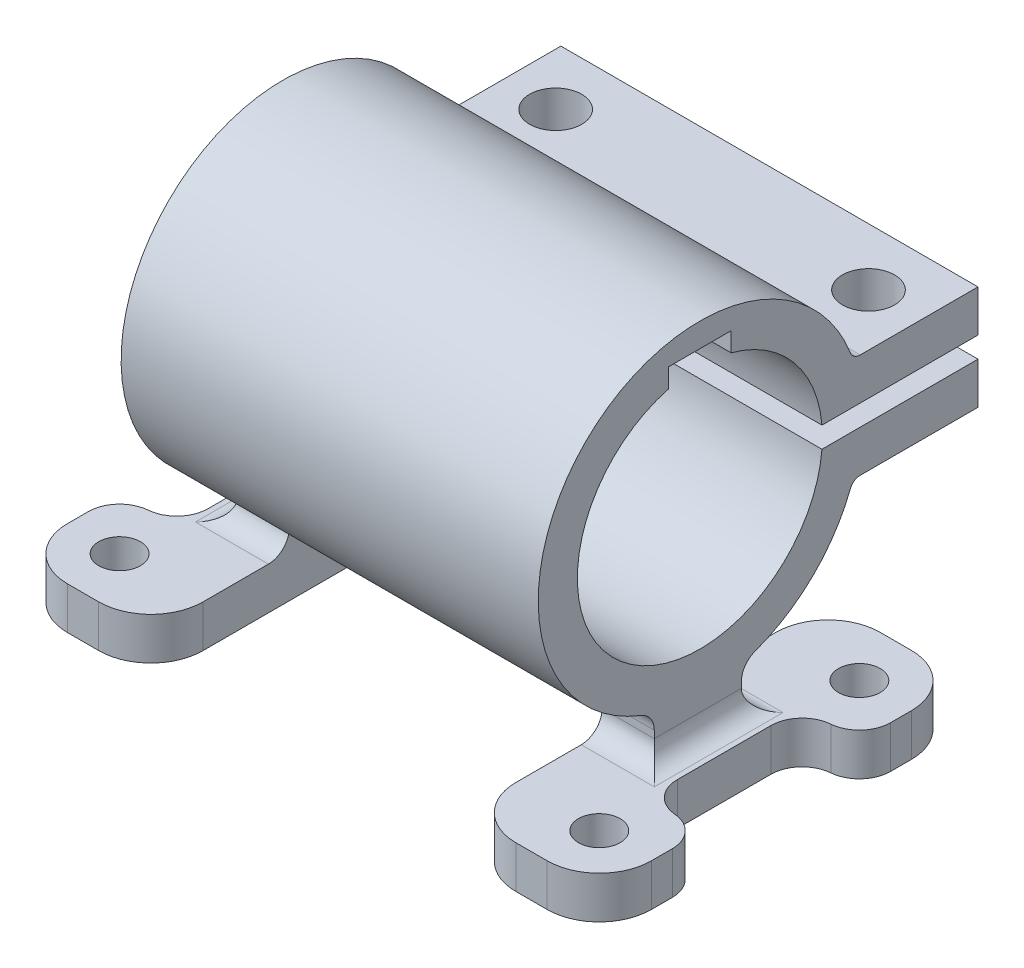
ISO-10303-21;
HEADER;
FILE_DESCRIPTION(('STEP AP214'),'2;1');
FILE_NAME('part.step','',(''),(''),'','','');
FILE_SCHEMA(('AUTOMOTIVE_DESIGN { 1 0 10303 214 1 1 1 1 }'));
ENDSEC;
DATA;
#1=APPLICATION_CONTEXT('core data for automotive mechanical design processes');
#2=APPLICATION_PROTOCOL_DEFINITION('international standard','automotive_design',2000,#1);
#3=PRODUCT_CONTEXT('',#1,'mechanical');
#4=PRODUCT('Part','Part','',(#3));
#5=PRODUCT_RELATED_PRODUCT_CATEGORY('part','',(#4));
#6=PRODUCT_DEFINITION_FORMATION('','',#4);
#7=PRODUCT_DEFINITION_CONTEXT('part definition',#1,'design');
#8=PRODUCT_DEFINITION('design','',#6,#7);
#9=PRODUCT_DEFINITION_SHAPE('','',#8);
#10=(LENGTH_UNIT() NAMED_UNIT(*) SI_UNIT(.MILLI.,.METRE.));
#11=(NAMED_UNIT(*) PLANE_ANGLE_UNIT() SI_UNIT($,.RADIAN.));
#12=(NAMED_UNIT(*) SI_UNIT($,.STERADIAN.) SOLID_ANGLE_UNIT());
#13=UNCERTAINTY_MEASURE_WITH_UNIT(LENGTH_MEASURE(1.E-05),#10,'distance_accuracy_value','');
#14=(GEOMETRIC_REPRESENTATION_CONTEXT(3) GLOBAL_UNCERTAINTY_ASSIGNED_CONTEXT((#13)) GLOBAL_UNIT_ASSIGNED_CONTEXT((#10,
#11,#12)) REPRESENTATION_CONTEXT('',''));
#15=CARTESIAN_POINT('',(0.,0.,0.));
#16=DIRECTION('',(0.,0.,1.));
#17=DIRECTION('',(1.,0.,0.));
#18=AXIS2_PLACEMENT_3D('',#15,#16,#17);
#19=CARTESIAN_POINT('',(40.,0.,0.));
#20=DIRECTION('',(-1.,0.,0.));
#21=DIRECTION('',(0.,0.,1.));
#22=AXIS2_PLACEMENT_3D('',#19,#20,#21);
#23=CYLINDRICAL_SURFACE('',#22,11.75);
#24=CARTESIAN_POINT('',(40.,0.,0.));
#25=DIRECTION('',(-1.,0.,0.));
#26=DIRECTION('',(0.,0.,-1.));
#27=AXIS2_PLACEMENT_3D('',#24,#25,#26);
#28=CIRCLE('',#27,11.75);
#29=CARTESIAN_POINT('',(40.,11.3605677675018,-3.));
#30=VERTEX_POINT('',#29);
#31=CARTESIAN_POINT('',(40.,1.,-11.7073694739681));
#32=VERTEX_POINT('',#31);
#33=EDGE_CURVE('E578',#30,#32,#28,.T.);
#34=ORIENTED_EDGE('',*,*,#33,.F.);
#35=DIRECTION('',(-1.,0.,0.));
#36=VECTOR('',#35,1.);
#37=CARTESIAN_POINT('',(40.,11.3605677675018,-3.));
#38=LINE('',#37,#36);
#39=CARTESIAN_POINT('',(0.,11.3605677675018,-3.));
#40=VERTEX_POINT('',#39);
#41=EDGE_CURVE('E436',#30,#40,#38,.T.);
#42=ORIENTED_EDGE('',*,*,#41,.T.);
#43=CARTESIAN_POINT('',(0.,0.,0.));
#44=DIRECTION('',(-1.,0.,0.));
#45=DIRECTION('',(0.,0.,-1.));
#46=AXIS2_PLACEMENT_3D('',#43,#44,#45);
#47=CIRCLE('',#46,11.75);
#48=CARTESIAN_POINT('',(0.,1.,-11.7073694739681));
#49=VERTEX_POINT('',#48);
#50=EDGE_CURVE('E603',#40,#49,#47,.T.);
#51=ORIENTED_EDGE('',*,*,#50,.T.);
#52=DIRECTION('',(-1.,0.,0.));
#53=VECTOR('',#52,1.);
#54=CARTESIAN_POINT('',(40.,1.,-11.7073694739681));
#55=LINE('',#54,#53);
#56=EDGE_CURVE('E631',#32,#49,#55,.T.);
#57=ORIENTED_EDGE('',*,*,#56,.F.);
#58=EDGE_LOOP('',(#34,#42,#51,#57));
#59=FACE_BOUND('',#58,.T.);
#60=ADVANCED_FACE('F34',(#59),#23,.F.);
#61=CARTESIAN_POINT('',(-8.,-23.05,17.6462428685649));
#62=DIRECTION('',(1.,0.,0.));
#63=DIRECTION('',(0.,0.,-1.));
#64=AXIS2_PLACEMENT_3D('',#61,#62,#63);
#65=PLANE('',#64);
#66=DIRECTION('',(0.,0.,-1.));
#67=VECTOR('',#66,1.);
#68=CARTESIAN_POINT('',(-8.,-23.05,17.6462428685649));
#69=LINE('',#68,#67);
#70=CARTESIAN_POINT('',(-8.,-23.05,-10.2909117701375));
#71=VERTEX_POINT('',#70);
#72=CARTESIAN_POINT('',(-8.,-23.05,-12.2909117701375));
#73=VERTEX_POINT('',#72);
#74=EDGE_CURVE('E506',#71,#73,#69,.T.);
#75=ORIENTED_EDGE('',*,*,#74,.F.);
#76=DIRECTION('',(0.,1.,0.));
#77=VECTOR('',#76,1.);
#78=CARTESIAN_POINT('',(-8.,-23.05,-10.2909117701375));
#79=LINE('',#78,#77);
#80=CARTESIAN_POINT('',(-8.,-19.,-10.2909117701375));
#81=VERTEX_POINT('',#80);
#82=EDGE_CURVE('E730',#71,#81,#79,.T.);
#83=ORIENTED_EDGE('',*,*,#82,.T.);
#84=DIRECTION('',(0.,0.,-1.));
#85=VECTOR('',#84,1.);
#86=CARTESIAN_POINT('',(-8.,-19.,17.6462428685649));
#87=LINE('',#86,#85);
#88=CARTESIAN_POINT('',(-8.,-19.,-12.2909117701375));
#89=VERTEX_POINT('',#88);
#90=EDGE_CURVE('E501',#81,#89,#87,.T.);
#91=ORIENTED_EDGE('',*,*,#90,.T.);
#92=DIRECTION('',(0.,1.,0.));
#93=VECTOR('',#92,1.);
#94=CARTESIAN_POINT('',(-8.,-23.05,-12.2909117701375));
#95=LINE('',#94,#93);
#96=EDGE_CURVE('E648',#89,#73,#95,.F.);
#97=ORIENTED_EDGE('',*,*,#96,.T.);
#98=EDGE_LOOP('',(#75,#83,#91,#97));
#99=FACE_BOUND('',#98,.T.);
#100=ADVANCED_FACE('F973',(#99),#65,.F.);
#101=CARTESIAN_POINT('',(48.,-23.05,17.6462428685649));
#102=DIRECTION('',(-1.,0.,0.));
#103=DIRECTION('',(0.,0.,1.));
#104=AXIS2_PLACEMENT_3D('',#101,#102,#103);
#105=PLANE('',#104);
#106=DIRECTION('',(0.,0.,1.));
#107=VECTOR('',#106,1.);
#108=CARTESIAN_POINT('',(48.,-19.,17.6462428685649));
#109=LINE('',#108,#107);
#110=CARTESIAN_POINT('',(48.,-19.,-12.2909117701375));
#111=VERTEX_POINT('',#110);
#112=CARTESIAN_POINT('',(48.,-19.,-10.2909117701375));
#113=VERTEX_POINT('',#112);
#114=EDGE_CURVE('E527',#111,#113,#109,.T.);
#115=ORIENTED_EDGE('',*,*,#114,.T.);
#116=DIRECTION('',(0.,-1.,0.));
#117=VECTOR('',#116,1.);
#118=CARTESIAN_POINT('',(48.,-23.05,-10.2909117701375));
#119=LINE('',#118,#117);
#120=CARTESIAN_POINT('',(48.,-23.05,-10.2909117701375));
#121=VERTEX_POINT('',#120);
#122=EDGE_CURVE('E759',#113,#121,#119,.T.);
#123=ORIENTED_EDGE('',*,*,#122,.T.);
#124=DIRECTION('',(0.,0.,1.));
#125=VECTOR('',#124,1.);
#126=CARTESIAN_POINT('',(48.,-23.05,17.6462428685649));
#127=LINE('',#126,#125);
#128=CARTESIAN_POINT('',(48.,-23.05,-12.2909117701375));
#129=VERTEX_POINT('',#128);
#130=EDGE_CURVE('E511',#129,#121,#127,.T.);
#131=ORIENTED_EDGE('',*,*,#130,.F.);
#132=DIRECTION('',(0.,1.,0.));
#133=VECTOR('',#132,1.);
#134=CARTESIAN_POINT('',(48.,-23.05,-12.2909117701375));
#135=LINE('',#134,#133);
#136=EDGE_CURVE('E689',#129,#111,#135,.T.);
#137=ORIENTED_EDGE('',*,*,#136,.T.);
#138=EDGE_LOOP('',(#115,#123,#131,#137));
#139=FACE_BOUND('',#138,.T.);
#140=ADVANCED_FACE('F980',(#139),#105,.F.);
#141=CARTESIAN_POINT('',(0.,-19.,0.));
#142=DIRECTION('',(0.,-1.,0.));
#143=DIRECTION('',(0.,0.,-1.));
#144=AXIS2_PLACEMENT_3D('',#141,#142,#143);
#145=PLANE('',#144);
#146=DIRECTION('',(0.,0.,-1.));
#147=VECTOR('',#146,1.);
#148=CARTESIAN_POINT('',(35.,-19.,20.5554437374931));
#149=LINE('',#148,#147);
#150=CARTESIAN_POINT('',(35.,-19.,-5.97361006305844));
#151=VERTEX_POINT('',#150);
#152=CARTESIAN_POINT('',(35.,-19.,-12.2909117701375));
#153=VERTEX_POINT('',#152);
#154=EDGE_CURVE('E461',#151,#153,#149,.T.);
#155=ORIENTED_EDGE('',*,*,#154,.F.);
#156=DIRECTION('',(-1.,0.,0.));
#157=VECTOR('',#156,1.);
#158=CARTESIAN_POINT('',(40.,-19.,-5.97361006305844));
#159=LINE('',#158,#157);
#160=CARTESIAN_POINT('',(42.,-19.,-5.97361006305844));
#161=VERTEX_POINT('',#160);
#162=EDGE_CURVE('E803',#151,#161,#159,.F.);
#163=ORIENTED_EDGE('',*,*,#162,.T.);
#164=DIRECTION('',(0.,0.,-1.));
#165=VECTOR('',#164,1.);
#166=CARTESIAN_POINT('',(42.,-19.,0.));
#167=LINE('',#166,#165);
#168=CARTESIAN_POINT('',(42.,-19.,6.37479033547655));
#169=VERTEX_POINT('',#168);
#170=EDGE_CURVE('E801',#161,#169,#167,.F.);
#171=ORIENTED_EDGE('',*,*,#170,.T.);
#172=DIRECTION('',(-1.,0.,0.));
#173=VECTOR('',#172,1.);
#174=CARTESIAN_POINT('',(35.,-19.,6.37479033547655));
#175=LINE('',#174,#173);
#176=CARTESIAN_POINT('',(35.,-19.,6.37479033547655));
#177=VERTEX_POINT('',#176);
#178=EDGE_CURVE('E799',#169,#177,#175,.T.);
#179=ORIENTED_EDGE('',*,*,#178,.T.);
#180=CARTESIAN_POINT('',(35.,-19.,12.6462428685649));
#181=VERTEX_POINT('',#180);
#182=EDGE_CURVE('E462',#181,#177,#149,.T.);
#183=ORIENTED_EDGE('',*,*,#182,.F.);
#184=CARTESIAN_POINT('',(40.,-19.,12.6462428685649));
#185=DIRECTION('',(0.,-1.,0.));
#186=DIRECTION('',(0.,0.,-1.));
#187=AXIS2_PLACEMENT_3D('',#184,#185,#186);
#188=CIRCLE('',#187,5.);
#189=CARTESIAN_POINT('',(40.,-19.,17.6462428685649));
#190=VERTEX_POINT('',#189);
#191=EDGE_CURVE('E701',#181,#190,#188,.F.);
#192=ORIENTED_EDGE('',*,*,#191,.T.);
#193=DIRECTION('',(-1.,0.,0.));
#194=VECTOR('',#193,1.);
#195=CARTESIAN_POINT('',(-8.,-19.,17.6462428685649));
#196=LINE('',#195,#194);
#197=CARTESIAN_POINT('',(43.,-19.,17.6462428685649));
#198=VERTEX_POINT('',#197);
#199=EDGE_CURVE('E531',#198,#190,#196,.T.);
#200=ORIENTED_EDGE('',*,*,#199,.F.);
#201=CARTESIAN_POINT('',(43.,-19.,12.6462428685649));
#202=DIRECTION('',(0.,-1.,0.));
#203=DIRECTION('',(0.,0.,-1.));
#204=AXIS2_PLACEMENT_3D('',#201,#202,#203);
#205=CIRCLE('',#204,5.);
#206=CARTESIAN_POINT('',(48.,-19.,12.6462428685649));
#207=VERTEX_POINT('',#206);
#208=EDGE_CURVE('E654',#198,#207,#205,.F.);
#209=ORIENTED_EDGE('',*,*,#208,.T.);
#210=CARTESIAN_POINT('',(48.,-19.,10.6462428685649));
#211=VERTEX_POINT('',#210);
#212=EDGE_CURVE('E526',#211,#207,#109,.T.);
#213=ORIENTED_EDGE('',*,*,#212,.F.);
#214=CARTESIAN_POINT('',(45.,-19.,10.6462428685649));
#215=DIRECTION('',(0.,-1.,0.));
#216=DIRECTION('',(0.,0.,-1.));
#217=AXIS2_PLACEMENT_3D('',#214,#215,#216);
#218=CIRCLE('',#217,3.);
#219=CARTESIAN_POINT('',(45.25,-19.,7.65667768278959));
#220=VERTEX_POINT('',#219);
#221=EDGE_CURVE('E751',#211,#220,#218,.F.);
#222=ORIENTED_EDGE('',*,*,#221,.T.);
#223=CARTESIAN_POINT('',(45.5,-19.,4.66711249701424));
#224=DIRECTION('',(0.,-1.,0.));
#225=DIRECTION('',(0.,0.,-1.));
#226=AXIS2_PLACEMENT_3D('',#223,#224,#225);
#227=CIRCLE('',#226,3.);
#228=CARTESIAN_POINT('',(42.5,-19.,4.66711249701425));
#229=VERTEX_POINT('',#228);
#230=EDGE_CURVE('E782',#220,#229,#227,.T.);
#231=ORIENTED_EDGE('',*,*,#230,.T.);
#232=DIRECTION('',(0.,0.,1.));
#233=VECTOR('',#232,1.);
#234=CARTESIAN_POINT('',(42.5,-19.,-7.29091177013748));
#235=LINE('',#234,#233);
#236=CARTESIAN_POINT('',(42.5,-19.,-4.31178139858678));
#237=VERTEX_POINT('',#236);
#238=EDGE_CURVE('E443',#237,#229,#235,.T.);
#239=ORIENTED_EDGE('',*,*,#238,.F.);
#240=CARTESIAN_POINT('',(45.5,-19.,-4.31178139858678));
#241=DIRECTION('',(0.,-1.,0.));
#242=DIRECTION('',(0.,0.,-1.));
#243=AXIS2_PLACEMENT_3D('',#240,#241,#242);
#244=CIRCLE('',#243,3.);
#245=CARTESIAN_POINT('',(45.25,-19.,-7.30134658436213));
#246=VERTEX_POINT('',#245);
#247=EDGE_CURVE('E786',#237,#246,#244,.T.);
#248=ORIENTED_EDGE('',*,*,#247,.T.);
#249=CARTESIAN_POINT('',(45.,-19.,-10.2909117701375));
#250=DIRECTION('',(0.,-1.,0.));
#251=DIRECTION('',(0.,0.,-1.));
#252=AXIS2_PLACEMENT_3D('',#249,#250,#251);
#253=CIRCLE('',#252,3.);
#254=EDGE_CURVE('E749',#246,#113,#253,.F.);
#255=ORIENTED_EDGE('',*,*,#254,.T.);
#256=ORIENTED_EDGE('',*,*,#114,.F.);
#257=CARTESIAN_POINT('',(43.,-19.,-12.2909117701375));
#258=DIRECTION('',(0.,-1.,0.));
#259=DIRECTION('',(0.,0.,-1.));
#260=AXIS2_PLACEMENT_3D('',#257,#258,#259);
#261=CIRCLE('',#260,5.);
#262=CARTESIAN_POINT('',(43.,-19.,-17.2909117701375));
#263=VERTEX_POINT('',#262);
#264=EDGE_CURVE('E657',#111,#263,#261,.F.);
#265=ORIENTED_EDGE('',*,*,#264,.T.);
#266=DIRECTION('',(1.,0.,0.));
#267=VECTOR('',#266,1.);
#268=CARTESIAN_POINT('',(-8.,-19.,-17.2909117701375));
#269=LINE('',#268,#267);
#270=CARTESIAN_POINT('',(40.,-19.,-17.2909117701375));
#271=VERTEX_POINT('',#270);
#272=EDGE_CURVE('E522',#271,#263,#269,.T.);
#273=ORIENTED_EDGE('',*,*,#272,.F.);
#274=CARTESIAN_POINT('',(40.,-19.,-12.2909117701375));
#275=DIRECTION('',(0.,-1.,0.));
#276=DIRECTION('',(0.,0.,-1.));
#277=AXIS2_PLACEMENT_3D('',#274,#275,#276);
#278=CIRCLE('',#277,5.);
#279=EDGE_CURVE('E698',#271,#153,#278,.F.);
#280=ORIENTED_EDGE('',*,*,#279,.T.);
#281=EDGE_LOOP('',(#155,#163,#171,#179,#183,#192,#200,#209,#213,#222,#231,#239,#248,#255,#256,
#265,#273,#280));
#282=FACE_BOUND('',#281,.T.);
#283=CARTESIAN_POINT('',(43.,-19.,12.6462428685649));
#284=DIRECTION('',(0.,-1.,0.));
#285=DIRECTION('',(0.,0.,-1.));
#286=AXIS2_PLACEMENT_3D('',#283,#284,#285);
#287=CIRCLE('',#286,2.);
#288=CARTESIAN_POINT('',(43.,-19.,10.6462428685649));
#289=VERTEX_POINT('',#288);
#290=EDGE_CURVE('E492',#289,#289,#287,.T.);
#291=ORIENTED_EDGE('',*,*,#290,.T.);
#292=EDGE_LOOP('',(#291));
#293=FACE_BOUND('',#292,.T.);
#294=CARTESIAN_POINT('',(43.,-19.,-12.2909117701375));
#295=DIRECTION('',(0.,-1.,0.));
#296=DIRECTION('',(0.,0.,-1.));
#297=AXIS2_PLACEMENT_3D('',#294,#295,#296);
#298=CIRCLE('',#297,2.);
#299=CARTESIAN_POINT('',(43.,-19.,-14.2909117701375));
#300=VERTEX_POINT('',#299);
#301=EDGE_CURVE('E486',#300,#300,#298,.T.);
#302=ORIENTED_EDGE('',*,*,#301,.T.);
#303=EDGE_LOOP('',(#302));
#304=FACE_BOUND('',#303,.T.);
#305=ADVANCED_FACE('F914',(#282,#293,#304),#145,.F.);
#306=CARTESIAN_POINT('',(-8.,-23.05,-17.2909117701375));
#307=DIRECTION('',(0.,0.,1.));
#308=DIRECTION('',(1.,0.,0.));
#309=AXIS2_PLACEMENT_3D('',#306,#307,#308);
#310=PLANE('',#309);
#311=DIRECTION('',(1.,0.,0.));
#312=VECTOR('',#311,1.);
#313=CARTESIAN_POINT('',(-8.,-23.05,-17.2909117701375));
#314=LINE('',#313,#312);
#315=CARTESIAN_POINT('',(40.,-23.05,-17.2909117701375));
#316=VERTEX_POINT('',#315);
#317=CARTESIAN_POINT('',(43.,-23.05,-17.2909117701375));
#318=VERTEX_POINT('',#317);
#319=EDGE_CURVE('E505',#316,#318,#314,.T.);
#320=ORIENTED_EDGE('',*,*,#319,.F.);
#321=DIRECTION('',(0.,-1.,0.));
#322=VECTOR('',#321,1.);
#323=CARTESIAN_POINT('',(40.,-23.05,-17.2909117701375));
#324=LINE('',#323,#322);
#325=EDGE_CURVE('E728',#316,#271,#324,.F.);
#326=ORIENTED_EDGE('',*,*,#325,.T.);
#327=ORIENTED_EDGE('',*,*,#272,.T.);
#328=DIRECTION('',(0.,1.,0.));
#329=VECTOR('',#328,1.);
#330=CARTESIAN_POINT('',(43.,-23.05,-17.2909117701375));
#331=LINE('',#330,#329);
#332=EDGE_CURVE('E680',#263,#318,#331,.F.);
#333=ORIENTED_EDGE('',*,*,#332,.T.);
#334=EDGE_LOOP('',(#320,#326,#327,#333));
#335=FACE_BOUND('',#334,.T.);
#336=ADVANCED_FACE('F1065',(#335),#310,.F.);
#337=CARTESIAN_POINT('',(-8.,-23.05,17.6462428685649));
#338=DIRECTION('',(0.,0.,-1.));
#339=DIRECTION('',(-1.,0.,0.));
#340=AXIS2_PLACEMENT_3D('',#337,#338,#339);
#341=PLANE('',#340);
#342=ORIENTED_EDGE('',*,*,#199,.T.);
#343=DIRECTION('',(0.,1.,0.));
#344=VECTOR('',#343,1.);
#345=CARTESIAN_POINT('',(40.,-23.05,17.6462428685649));
#346=LINE('',#345,#344);
#347=CARTESIAN_POINT('',(40.,-23.05,17.6462428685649));
#348=VERTEX_POINT('',#347);
#349=EDGE_CURVE('E703',#190,#348,#346,.F.);
#350=ORIENTED_EDGE('',*,*,#349,.T.);
#351=DIRECTION('',(-1.,0.,0.));
#352=VECTOR('',#351,1.);
#353=CARTESIAN_POINT('',(-8.,-23.05,17.6462428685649));
#354=LINE('',#353,#352);
#355=CARTESIAN_POINT('',(43.,-23.05,17.6462428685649));
#356=VERTEX_POINT('',#355);
#357=EDGE_CURVE('E515',#356,#348,#354,.T.);
#358=ORIENTED_EDGE('',*,*,#357,.F.);
#359=DIRECTION('',(0.,1.,0.));
#360=VECTOR('',#359,1.);
#361=CARTESIAN_POINT('',(43.,-23.05,17.6462428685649));
#362=LINE('',#361,#360);
#363=EDGE_CURVE('E666',#356,#198,#362,.T.);
#364=ORIENTED_EDGE('',*,*,#363,.T.);
#365=EDGE_LOOP('',(#342,#350,#358,#364));
#366=FACE_BOUND('',#365,.T.);
#367=ADVANCED_FACE('F1074',(#366),#341,.F.);
#368=CARTESIAN_POINT('',(0.,-23.05,0.));
#369=DIRECTION('',(0.,-1.,0.));
#370=DIRECTION('',(0.,0.,-1.));
#371=AXIS2_PLACEMENT_3D('',#368,#369,#370);
#372=PLANE('',#371);
#373=DIRECTION('',(0.,0.,1.));
#374=VECTOR('',#373,1.);
#375=CARTESIAN_POINT('',(42.5,-23.05,-7.29091177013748));
#376=LINE('',#375,#374);
#377=CARTESIAN_POINT('',(42.5,-23.05,-4.31178139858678));
#378=VERTEX_POINT('',#377);
#379=CARTESIAN_POINT('',(42.5,-23.05,4.66711249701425));
#380=VERTEX_POINT('',#379);
#381=EDGE_CURVE('E446',#378,#380,#376,.T.);
#382=ORIENTED_EDGE('',*,*,#381,.T.);
#383=CARTESIAN_POINT('',(45.5,-23.05,4.66711249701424));
#384=DIRECTION('',(0.,-1.,0.));
#385=DIRECTION('',(0.,0.,-1.));
#386=AXIS2_PLACEMENT_3D('',#383,#384,#385);
#387=CIRCLE('',#386,3.);
#388=CARTESIAN_POINT('',(45.25,-23.05,7.65667768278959));
#389=VERTEX_POINT('',#388);
#390=EDGE_CURVE('E784',#380,#389,#387,.F.);
#391=ORIENTED_EDGE('',*,*,#390,.T.);
#392=CARTESIAN_POINT('',(45.,-23.05,10.6462428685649));
#393=DIRECTION('',(0.,-1.,0.));
#394=DIRECTION('',(0.,0.,-1.));
#395=AXIS2_PLACEMENT_3D('',#392,#393,#394);
#396=CIRCLE('',#395,3.);
#397=CARTESIAN_POINT('',(48.,-23.05,10.6462428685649));
#398=VERTEX_POINT('',#397);
#399=EDGE_CURVE('E757',#389,#398,#396,.T.);
#400=ORIENTED_EDGE('',*,*,#399,.T.);
#401=CARTESIAN_POINT('',(48.,-23.05,12.6462428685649));
#402=VERTEX_POINT('',#401);
#403=EDGE_CURVE('E510',#398,#402,#127,.T.);
#404=ORIENTED_EDGE('',*,*,#403,.T.);
#405=CARTESIAN_POINT('',(43.,-23.05,12.6462428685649));
#406=DIRECTION('',(0.,-1.,0.));
#407=DIRECTION('',(0.,0.,-1.));
#408=AXIS2_PLACEMENT_3D('',#405,#406,#407);
#409=CIRCLE('',#408,5.);
#410=EDGE_CURVE('E672',#402,#356,#409,.T.);
#411=ORIENTED_EDGE('',*,*,#410,.T.);
#412=ORIENTED_EDGE('',*,*,#357,.T.);
#413=CARTESIAN_POINT('',(40.,-23.05,12.6462428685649));
#414=DIRECTION('',(0.,-1.,0.));
#415=DIRECTION('',(0.,0.,-1.));
#416=AXIS2_PLACEMENT_3D('',#413,#414,#415);
#417=CIRCLE('',#416,5.);
#418=CARTESIAN_POINT('',(35.,-23.05,12.6462428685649));
#419=VERTEX_POINT('',#418);
#420=EDGE_CURVE('E707',#348,#419,#417,.T.);
#421=ORIENTED_EDGE('',*,*,#420,.T.);
#422=DIRECTION('',(0.,0.,1.));
#423=VECTOR('',#422,1.);
#424=CARTESIAN_POINT('',(35.,-23.05,20.5554437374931));
#425=LINE('',#424,#423);
#426=CARTESIAN_POINT('',(35.,-23.05,-12.2909117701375));
#427=VERTEX_POINT('',#426);
#428=EDGE_CURVE('E458',#427,#419,#425,.T.);
#429=ORIENTED_EDGE('',*,*,#428,.F.);
#430=CARTESIAN_POINT('',(40.,-23.05,-12.2909117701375));
#431=DIRECTION('',(0.,-1.,0.));
#432=DIRECTION('',(0.,0.,-1.));
#433=AXIS2_PLACEMENT_3D('',#430,#431,#432);
#434=CIRCLE('',#433,5.);
#435=EDGE_CURVE('E705',#427,#316,#434,.T.);
#436=ORIENTED_EDGE('',*,*,#435,.T.);
#437=ORIENTED_EDGE('',*,*,#319,.T.);
#438=CARTESIAN_POINT('',(43.,-23.05,-12.2909117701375));
#439=DIRECTION('',(0.,-1.,0.));
#440=DIRECTION('',(0.,0.,-1.));
#441=AXIS2_PLACEMENT_3D('',#438,#439,#440);
#442=CIRCLE('',#441,5.);
#443=EDGE_CURVE('E674',#318,#129,#442,.T.);
#444=ORIENTED_EDGE('',*,*,#443,.T.);
#445=ORIENTED_EDGE('',*,*,#130,.T.);
#446=CARTESIAN_POINT('',(45.,-23.05,-10.2909117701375));
#447=DIRECTION('',(0.,-1.,0.));
#448=DIRECTION('',(0.,0.,-1.));
#449=AXIS2_PLACEMENT_3D('',#446,#447,#448);
#450=CIRCLE('',#449,3.);
#451=CARTESIAN_POINT('',(45.25,-23.05,-7.30134658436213));
#452=VERTEX_POINT('',#451);
#453=EDGE_CURVE('E754',#121,#452,#450,.T.);
#454=ORIENTED_EDGE('',*,*,#453,.T.);
#455=CARTESIAN_POINT('',(45.5,-23.05,-4.31178139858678));
#456=DIRECTION('',(0.,-1.,0.));
#457=DIRECTION('',(0.,0.,-1.));
#458=AXIS2_PLACEMENT_3D('',#455,#456,#457);
#459=CIRCLE('',#458,3.);
#460=EDGE_CURVE('E788',#452,#378,#459,.F.);
#461=ORIENTED_EDGE('',*,*,#460,.T.);
#462=EDGE_LOOP('',(#382,#391,#400,#404,#411,#412,#421,#429,#436,#437,#444,#445,#454,#461));
#463=FACE_BOUND('',#462,.T.);
#464=CARTESIAN_POINT('',(43.,-23.05,12.6462428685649));
#465=DIRECTION('',(0.,-1.,0.));
#466=DIRECTION('',(0.,0.,-1.));
#467=AXIS2_PLACEMENT_3D('',#464,#465,#466);
#468=CIRCLE('',#467,2.);
#469=CARTESIAN_POINT('',(43.,-23.05,10.6462428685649));
#470=VERTEX_POINT('',#469);
#471=EDGE_CURVE('E489',#470,#470,#468,.T.);
#472=ORIENTED_EDGE('',*,*,#471,.F.);
#473=EDGE_LOOP('',(#472));
#474=FACE_BOUND('',#473,.T.);
#475=CARTESIAN_POINT('',(43.,-23.05,-12.2909117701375));
#476=DIRECTION('',(0.,-1.,0.));
#477=DIRECTION('',(0.,0.,-1.));
#478=AXIS2_PLACEMENT_3D('',#475,#476,#477);
#479=CIRCLE('',#478,2.);
#480=CARTESIAN_POINT('',(43.,-23.05,-14.2909117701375));
#481=VERTEX_POINT('',#480);
#482=EDGE_CURVE('E483',#481,#481,#479,.T.);
#483=ORIENTED_EDGE('',*,*,#482,.F.);
#484=EDGE_LOOP('',(#483));
#485=FACE_BOUND('',#484,.T.);
#486=ADVANCED_FACE('F926',(#463,#474,#485),#372,.T.);
#487=CARTESIAN_POINT('',(40.,0.,0.));
#488=DIRECTION('',(-1.,0.,0.));
#489=DIRECTION('',(0.,0.,1.));
#490=AXIS2_PLACEMENT_3D('',#487,#488,#489);
#491=CYLINDRICAL_SURFACE('',#490,15.5);
#492=CARTESIAN_POINT('',(35.,0.,0.));
#493=DIRECTION('',(1.,0.,0.));
#494=DIRECTION('',(0.,0.,-1.));
#495=AXIS2_PLACEMENT_3D('',#492,#493,#494);
#496=CIRCLE('',#495,15.5);
#497=CARTESIAN_POINT('',(35.,-14.4350248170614,5.64624286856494));
#498=VERTEX_POINT('',#497);
#499=CARTESIAN_POINT('',(35.,-14.5690168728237,-5.29091177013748));
#500=VERTEX_POINT('',#499);
#501=EDGE_CURVE('E646',#498,#500,#496,.T.);
#502=ORIENTED_EDGE('',*,*,#501,.F.);
#503=DIRECTION('',(-1.,0.,0.));
#504=VECTOR('',#503,1.);
#505=CARTESIAN_POINT('',(40.,-14.4350248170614,5.64624286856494));
#506=LINE('',#505,#504);
#507=CARTESIAN_POINT('',(40.,-14.4350248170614,5.64624286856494));
#508=VERTEX_POINT('',#507);
#509=EDGE_CURVE('E856',#498,#508,#506,.F.);
#510=ORIENTED_EDGE('',*,*,#509,.T.);
#511=CARTESIAN_POINT('',(40.,0.,0.));
#512=DIRECTION('',(1.,0.,0.));
#513=DIRECTION('',(0.,0.,-1.));
#514=AXIS2_PLACEMENT_3D('',#511,#512,#513);
#515=CIRCLE('',#514,15.5);
#516=CARTESIAN_POINT('',(40.,5.63636363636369,-14.4388851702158));
#517=VERTEX_POINT('',#516);
#518=EDGE_CURVE('E591',#517,#508,#515,.T.);
#519=ORIENTED_EDGE('',*,*,#518,.F.);
#520=DIRECTION('',(-1.,0.,0.));
#521=VECTOR('',#520,1.);
#522=CARTESIAN_POINT('',(40.,5.63636363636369,-14.4388851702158));
#523=LINE('',#522,#521);
#524=CARTESIAN_POINT('',(0.,5.63636363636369,-14.4388851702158));
#525=VERTEX_POINT('',#524);
#526=EDGE_CURVE('E619',#517,#525,#523,.T.);
#527=ORIENTED_EDGE('',*,*,#526,.T.);
#528=CARTESIAN_POINT('',(0.,0.,0.));
#529=DIRECTION('',(1.,0.,0.));
#530=DIRECTION('',(0.,0.,-1.));
#531=AXIS2_PLACEMENT_3D('',#528,#529,#530);
#532=CIRCLE('',#531,15.5);
#533=CARTESIAN_POINT('',(0.,-14.4350248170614,5.64624286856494));
#534=VERTEX_POINT('',#533);
#535=EDGE_CURVE('E572',#525,#534,#532,.T.);
#536=ORIENTED_EDGE('',*,*,#535,.T.);
#537=DIRECTION('',(-1.,0.,0.));
#538=VECTOR('',#537,1.);
#539=CARTESIAN_POINT('',(40.,-14.4350248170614,5.64624286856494));
#540=LINE('',#539,#538);
#541=CARTESIAN_POINT('',(5.,-14.4350248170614,5.64624286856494));
#542=VERTEX_POINT('',#541);
#543=EDGE_CURVE('E847',#534,#542,#540,.F.);
#544=ORIENTED_EDGE('',*,*,#543,.T.);
#545=CARTESIAN_POINT('',(5.,0.,0.));
#546=DIRECTION('',(-1.,0.,0.));
#547=DIRECTION('',(0.,0.,1.));
#548=AXIS2_PLACEMENT_3D('',#545,#546,#547);
#549=CIRCLE('',#548,15.5);
#550=CARTESIAN_POINT('',(5.,-14.5690168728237,-5.29091177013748));
#551=VERTEX_POINT('',#550);
#552=EDGE_CURVE('E472',#551,#542,#549,.T.);
#553=ORIENTED_EDGE('',*,*,#552,.F.);
#554=DIRECTION('',(-1.,0.,0.));
#555=VECTOR('',#554,1.);
#556=CARTESIAN_POINT('',(40.,-14.5690168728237,-5.29091177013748));
#557=LINE('',#556,#555);
#558=CARTESIAN_POINT('',(0.,-14.5690168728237,-5.29091177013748));
#559=VERTEX_POINT('',#558);
#560=EDGE_CURVE('E850',#551,#559,#557,.T.);
#561=ORIENTED_EDGE('',*,*,#560,.T.);
#562=CARTESIAN_POINT('',(0.,-5.63636363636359,-14.4388851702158));
#563=VERTEX_POINT('',#562);
#564=EDGE_CURVE('E614',#559,#563,#532,.T.);
#565=ORIENTED_EDGE('',*,*,#564,.T.);
#566=DIRECTION('',(-1.,0.,0.));
#567=VECTOR('',#566,1.);
#568=CARTESIAN_POINT('',(40.,-5.63636363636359,-14.4388851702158));
#569=LINE('',#568,#567);
#570=CARTESIAN_POINT('',(40.,-5.63636363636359,-14.4388851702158));
#571=VERTEX_POINT('',#570);
#572=EDGE_CURVE('E594',#571,#563,#569,.T.);
#573=ORIENTED_EDGE('',*,*,#572,.F.);
#574=CARTESIAN_POINT('',(40.,-14.5690168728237,-5.29091177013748));
#575=VERTEX_POINT('',#574);
#576=EDGE_CURVE('E590',#575,#571,#515,.T.);
#577=ORIENTED_EDGE('',*,*,#576,.F.);
#578=DIRECTION('',(-1.,0.,0.));
#579=VECTOR('',#578,1.);
#580=CARTESIAN_POINT('',(40.,-14.5690168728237,-5.29091177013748));
#581=LINE('',#580,#579);
#582=EDGE_CURVE('E853',#575,#500,#581,.T.);
#583=ORIENTED_EDGE('',*,*,#582,.T.);
#584=EDGE_LOOP('',(#502,#510,#519,#527,#536,#544,#553,#561,#565,#573,#577,#583));
#585=FACE_BOUND('',#584,.T.);
#586=ADVANCED_FACE('F886',(#585),#491,.T.);
#587=CARTESIAN_POINT('',(40.,-5.99999999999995,-15.3704261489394));
#588=DIRECTION('',(-1.,0.,0.));
#589=DIRECTION('',(0.,0.,1.));
#590=AXIS2_PLACEMENT_3D('',#587,#588,#589);
#591=CYLINDRICAL_SURFACE('',#590,1.);
#592=CARTESIAN_POINT('',(0.,-5.99999999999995,-15.3704261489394));
#593=DIRECTION('',(-1.,0.,0.));
#594=DIRECTION('',(0.,0.,-1.));
#595=AXIS2_PLACEMENT_3D('',#592,#593,#594);
#596=CIRCLE('',#595,1.);
#597=CARTESIAN_POINT('',(0.,-4.99999999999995,-15.3704261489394));
#598=VERTEX_POINT('',#597);
#599=EDGE_CURVE('E567',#563,#598,#596,.T.);
#600=ORIENTED_EDGE('',*,*,#599,.T.);
#601=DIRECTION('',(-1.,0.,0.));
#602=VECTOR('',#601,1.);
#603=CARTESIAN_POINT('',(40.,-4.99999999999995,-15.3704261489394));
#604=LINE('',#603,#602);
#605=CARTESIAN_POINT('',(40.,-4.99999999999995,-15.3704261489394));
#606=VERTEX_POINT('',#605);
#607=EDGE_CURVE('E643',#606,#598,#604,.T.);
#608=ORIENTED_EDGE('',*,*,#607,.F.);
#609=CARTESIAN_POINT('',(40.,-5.99999999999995,-15.3704261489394));
#610=DIRECTION('',(-1.,0.,0.));
#611=DIRECTION('',(0.,0.,-1.));
#612=AXIS2_PLACEMENT_3D('',#609,#610,#611);
#613=CIRCLE('',#612,1.);
#614=EDGE_CURVE('E568',#571,#606,#613,.T.);
#615=ORIENTED_EDGE('',*,*,#614,.F.);
#616=ORIENTED_EDGE('',*,*,#572,.T.);
#617=EDGE_LOOP('',(#600,#608,#615,#616));
#618=FACE_BOUND('',#617,.T.);
#619=ADVANCED_FACE('F892',(#618),#591,.F.);
#620=CARTESIAN_POINT('',(40.,-4.99999999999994,-26.6714007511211));
#621=DIRECTION('',(0.,1.,0.));
#622=DIRECTION('',(0.,0.,1.));
#623=AXIS2_PLACEMENT_3D('',#620,#621,#622);
#624=PLANE('',#623);
#625=CARTESIAN_POINT('',(35.,-4.99999999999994,-21.1714007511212));
#626=DIRECTION('',(0.,1.,0.));
#627=DIRECTION('',(0.,0.,1.));
#628=AXIS2_PLACEMENT_3D('',#625,#626,#627);
#629=CIRCLE('',#628,2.5);
#630=CARTESIAN_POINT('',(35.,-4.99999999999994,-18.6714007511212));
#631=VERTEX_POINT('',#630);
#632=EDGE_CURVE('E552',#631,#631,#629,.T.);
#633=ORIENTED_EDGE('',*,*,#632,.T.);
#634=EDGE_LOOP('',(#633));
#635=FACE_BOUND('',#634,.T.);
#636=CARTESIAN_POINT('',(5.,-4.99999999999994,-21.1714007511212));
#637=DIRECTION('',(0.,1.,0.));
#638=DIRECTION('',(0.,0.,1.));
#639=AXIS2_PLACEMENT_3D('',#636,#637,#638);
#640=CIRCLE('',#639,2.5);
#641=CARTESIAN_POINT('',(5.,-4.99999999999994,-18.6714007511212));
#642=VERTEX_POINT('',#641);
#643=EDGE_CURVE('E564',#642,#642,#640,.T.);
#644=ORIENTED_EDGE('',*,*,#643,.T.);
#645=EDGE_LOOP('',(#644));
#646=FACE_BOUND('',#645,.T.);
#647=DIRECTION('',(0.,0.,-1.));
#648=VECTOR('',#647,1.);
#649=CARTESIAN_POINT('',(0.,-4.99999999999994,-26.6714007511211));
#650=LINE('',#649,#648);
#651=CARTESIAN_POINT('',(0.,-4.99999999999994,-26.6714007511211));
#652=VERTEX_POINT('',#651);
#653=EDGE_CURVE('E597',#598,#652,#650,.T.);
#654=ORIENTED_EDGE('',*,*,#653,.T.);
#655=DIRECTION('',(-1.,0.,0.));
#656=VECTOR('',#655,1.);
#657=CARTESIAN_POINT('',(40.,-4.99999999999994,-26.6714007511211));
#658=LINE('',#657,#656);
#659=CARTESIAN_POINT('',(40.,-4.99999999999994,-26.6714007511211));
#660=VERTEX_POINT('',#659);
#661=EDGE_CURVE('E640',#660,#652,#658,.T.);
#662=ORIENTED_EDGE('',*,*,#661,.F.);
#663=DIRECTION('',(0.,0.,-1.));
#664=VECTOR('',#663,1.);
#665=CARTESIAN_POINT('',(40.,-4.99999999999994,-26.6714007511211));
#666=LINE('',#665,#664);
#667=EDGE_CURVE('E571',#606,#660,#666,.T.);
#668=ORIENTED_EDGE('',*,*,#667,.F.);
#669=ORIENTED_EDGE('',*,*,#607,.T.);
#670=EDGE_LOOP('',(#654,#662,#668,#669));
#671=FACE_BOUND('',#670,.T.);
#672=ADVANCED_FACE('F1009',(#635,#646,#671),#624,.F.);
#673=CARTESIAN_POINT('',(40.,-1.,-26.6714007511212));
#674=DIRECTION('',(0.,0.,1.));
#675=DIRECTION('',(0.,-1.,0.));
#676=AXIS2_PLACEMENT_3D('',#673,#674,#675);
#677=PLANE('',#676);
#678=DIRECTION('',(0.,1.,0.));
#679=VECTOR('',#678,1.);
#680=CARTESIAN_POINT('',(0.,-1.,-26.6714007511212));
#681=LINE('',#680,#679);
#682=CARTESIAN_POINT('',(0.,-1.,-26.6714007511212));
#683=VERTEX_POINT('',#682);
#684=EDGE_CURVE('E599',#652,#683,#681,.T.);
#685=ORIENTED_EDGE('',*,*,#684,.T.);
#686=DIRECTION('',(-1.,0.,0.));
#687=VECTOR('',#686,1.);
#688=CARTESIAN_POINT('',(40.,-1.,-26.6714007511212));
#689=LINE('',#688,#687);
#690=CARTESIAN_POINT('',(40.,-1.,-26.6714007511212));
#691=VERTEX_POINT('',#690);
#692=EDGE_CURVE('E637',#691,#683,#689,.T.);
#693=ORIENTED_EDGE('',*,*,#692,.F.);
#694=DIRECTION('',(0.,1.,0.));
#695=VECTOR('',#694,1.);
#696=CARTESIAN_POINT('',(40.,-1.,-26.6714007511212));
#697=LINE('',#696,#695);
#698=EDGE_CURVE('E574',#660,#691,#697,.T.);
#699=ORIENTED_EDGE('',*,*,#698,.F.);
#700=ORIENTED_EDGE('',*,*,#661,.T.);
#701=EDGE_LOOP('',(#685,#693,#699,#700));
#702=FACE_BOUND('',#701,.T.);
#703=ADVANCED_FACE('F997',(#702),#677,.F.);
#704=CARTESIAN_POINT('',(40.,-1.,-11.7073694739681));
#705=DIRECTION('',(0.,-1.,0.));
#706=DIRECTION('',(0.,0.,-1.));
#707=AXIS2_PLACEMENT_3D('',#704,#705,#706);
#708=PLANE('',#707);
#709=CARTESIAN_POINT('',(35.,-1.,-21.1714007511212));
#710=DIRECTION('',(0.,-1.,0.));
#711=DIRECTION('',(0.,0.,-1.));
#712=AXIS2_PLACEMENT_3D('',#709,#710,#711);
#713=CIRCLE('',#712,2.5);
#714=CARTESIAN_POINT('',(35.,-1.,-23.6714007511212));
#715=VERTEX_POINT('',#714);
#716=EDGE_CURVE('E549',#715,#715,#713,.T.);
#717=ORIENTED_EDGE('',*,*,#716,.T.);
#718=EDGE_LOOP('',(#717));
#719=FACE_BOUND('',#718,.T.);
#720=CARTESIAN_POINT('',(5.,-1.,-21.1714007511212));
#721=DIRECTION('',(0.,-1.,0.));
#722=DIRECTION('',(0.,0.,-1.));
#723=AXIS2_PLACEMENT_3D('',#720,#721,#722);
#724=CIRCLE('',#723,2.5);
#725=CARTESIAN_POINT('',(5.,-1.,-23.6714007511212));
#726=VERTEX_POINT('',#725);
#727=EDGE_CURVE('E561',#726,#726,#724,.T.);
#728=ORIENTED_EDGE('',*,*,#727,.T.);
#729=EDGE_LOOP('',(#728));
#730=FACE_BOUND('',#729,.T.);
#731=DIRECTION('',(0.,0.,1.));
#732=VECTOR('',#731,1.);
#733=CARTESIAN_POINT('',(0.,-1.,-11.7073694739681));
#734=LINE('',#733,#732);
#735=CARTESIAN_POINT('',(0.,-1.,-11.7073694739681));
#736=VERTEX_POINT('',#735);
#737=EDGE_CURVE('E601',#683,#736,#734,.T.);
#738=ORIENTED_EDGE('',*,*,#737,.T.);
#739=DIRECTION('',(-1.,0.,0.));
#740=VECTOR('',#739,1.);
#741=CARTESIAN_POINT('',(40.,-1.,-11.7073694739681));
#742=LINE('',#741,#740);
#743=CARTESIAN_POINT('',(40.,-1.,-11.7073694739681));
#744=VERTEX_POINT('',#743);
#745=EDGE_CURVE('E634',#744,#736,#742,.T.);
#746=ORIENTED_EDGE('',*,*,#745,.F.);
#747=DIRECTION('',(0.,0.,1.));
#748=VECTOR('',#747,1.);
#749=CARTESIAN_POINT('',(40.,-1.,-11.7073694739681));
#750=LINE('',#749,#748);
#751=EDGE_CURVE('E576',#691,#744,#750,.T.);
#752=ORIENTED_EDGE('',*,*,#751,.F.);
#753=ORIENTED_EDGE('',*,*,#692,.T.);
#754=EDGE_LOOP('',(#738,#746,#752,#753));
#755=FACE_BOUND('',#754,.T.);
#756=ADVANCED_FACE('F989',(#719,#730,#755),#708,.F.);
#757=CARTESIAN_POINT('',(0.,11.3605677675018,3.));
#758=VERTEX_POINT('',#757);
#759=EDGE_CURVE('E604',#736,#758,#47,.T.);
#760=ORIENTED_EDGE('',*,*,#759,.T.);
#761=DIRECTION('',(-1.,0.,0.));
#762=VECTOR('',#761,1.);
#763=CARTESIAN_POINT('',(40.,11.3605677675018,3.));
#764=LINE('',#763,#762);
#765=CARTESIAN_POINT('',(40.,11.3605677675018,3.));
#766=VERTEX_POINT('',#765);
#767=EDGE_CURVE('E414',#758,#766,#764,.F.);
#768=ORIENTED_EDGE('',*,*,#767,.T.);
#769=EDGE_CURVE('E579',#744,#766,#28,.T.);
#770=ORIENTED_EDGE('',*,*,#769,.F.);
#771=ORIENTED_EDGE('',*,*,#745,.T.);
#772=EDGE_LOOP('',(#760,#768,#770,#771));
#773=FACE_BOUND('',#772,.T.);
#774=ADVANCED_FACE('F976',(#773),#23,.F.);
#775=CARTESIAN_POINT('',(40.,1.,-11.7073694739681));
#776=DIRECTION('',(0.,1.,0.));
#777=DIRECTION('',(0.,0.,1.));
#778=AXIS2_PLACEMENT_3D('',#775,#776,#777);
#779=PLANE('',#778);
#780=CARTESIAN_POINT('',(35.,1.,-21.1714007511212));
#781=DIRECTION('',(0.,1.,0.));
#782=DIRECTION('',(0.,0.,1.));
#783=AXIS2_PLACEMENT_3D('',#780,#781,#782);
#784=CIRCLE('',#783,2.5);
#785=CARTESIAN_POINT('',(35.,1.,-18.6714007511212));
#786=VERTEX_POINT('',#785);
#787=EDGE_CURVE('E546',#786,#786,#784,.T.);
#788=ORIENTED_EDGE('',*,*,#787,.T.);
#789=EDGE_LOOP('',(#788));
#790=FACE_BOUND('',#789,.T.);
#791=CARTESIAN_POINT('',(5.,1.,-21.1714007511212));
#792=DIRECTION('',(0.,1.,0.));
#793=DIRECTION('',(0.,0.,1.));
#794=AXIS2_PLACEMENT_3D('',#791,#792,#793);
#795=CIRCLE('',#794,2.5);
#796=CARTESIAN_POINT('',(5.,1.,-18.6714007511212));
#797=VERTEX_POINT('',#796);
#798=EDGE_CURVE('E558',#797,#797,#795,.T.);
#799=ORIENTED_EDGE('',*,*,#798,.T.);
#800=EDGE_LOOP('',(#799));
#801=FACE_BOUND('',#800,.T.);
#802=DIRECTION('',(0.,0.,-1.));
#803=VECTOR('',#802,1.);
#804=CARTESIAN_POINT('',(0.,1.,-11.7073694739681));
#805=LINE('',#804,#803);
#806=CARTESIAN_POINT('',(0.,1.,-26.6714007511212));
#807=VERTEX_POINT('',#806);
#808=EDGE_CURVE('E606',#49,#807,#805,.T.);
#809=ORIENTED_EDGE('',*,*,#808,.T.);
#810=DIRECTION('',(-1.,0.,0.));
#811=VECTOR('',#810,1.);
#812=CARTESIAN_POINT('',(40.,1.,-26.6714007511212));
#813=LINE('',#812,#811);
#814=CARTESIAN_POINT('',(40.,1.,-26.6714007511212));
#815=VERTEX_POINT('',#814);
#816=EDGE_CURVE('E628',#815,#807,#813,.T.);
#817=ORIENTED_EDGE('',*,*,#816,.F.);
#818=DIRECTION('',(0.,0.,-1.));
#819=VECTOR('',#818,1.);
#820=CARTESIAN_POINT('',(40.,1.,-11.7073694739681));
#821=LINE('',#820,#819);
#822=EDGE_CURVE('E582',#32,#815,#821,.T.);
#823=ORIENTED_EDGE('',*,*,#822,.F.);
#824=ORIENTED_EDGE('',*,*,#56,.T.);
#825=EDGE_LOOP('',(#809,#817,#823,#824));
#826=FACE_BOUND('',#825,.T.);
#827=ADVANCED_FACE('F988',(#790,#801,#826),#779,.F.);
#828=CARTESIAN_POINT('',(40.,5.00000000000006,-26.6714007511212));
#829=DIRECTION('',(0.,0.,1.));
#830=DIRECTION('',(0.,-1.,0.));
#831=AXIS2_PLACEMENT_3D('',#828,#829,#830);
#832=PLANE('',#831);
#833=DIRECTION('',(0.,1.,0.));
#834=VECTOR('',#833,1.);
#835=CARTESIAN_POINT('',(0.,5.00000000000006,-26.6714007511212));
#836=LINE('',#835,#834);
#837=CARTESIAN_POINT('',(0.,5.00000000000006,-26.6714007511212));
#838=VERTEX_POINT('',#837);
#839=EDGE_CURVE('E608',#807,#838,#836,.T.);
#840=ORIENTED_EDGE('',*,*,#839,.T.);
#841=DIRECTION('',(-1.,0.,0.));
#842=VECTOR('',#841,1.);
#843=CARTESIAN_POINT('',(40.,5.00000000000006,-26.6714007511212));
#844=LINE('',#843,#842);
#845=CARTESIAN_POINT('',(40.,5.00000000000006,-26.6714007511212));
#846=VERTEX_POINT('',#845);
#847=EDGE_CURVE('E625',#846,#838,#844,.T.);
#848=ORIENTED_EDGE('',*,*,#847,.F.);
#849=DIRECTION('',(0.,1.,0.));
#850=VECTOR('',#849,1.);
#851=CARTESIAN_POINT('',(40.,5.00000000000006,-26.6714007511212));
#852=LINE('',#851,#850);
#853=EDGE_CURVE('E584',#815,#846,#852,.T.);
#854=ORIENTED_EDGE('',*,*,#853,.F.);
#855=ORIENTED_EDGE('',*,*,#816,.T.);
#856=EDGE_LOOP('',(#840,#848,#854,#855));
#857=FACE_BOUND('',#856,.T.);
#858=ADVANCED_FACE('F995',(#857),#832,.F.);
#859=CARTESIAN_POINT('',(40.,5.00000000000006,-15.3704261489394));
#860=DIRECTION('',(0.,-1.,0.));
#861=DIRECTION('',(0.,0.,-1.));
#862=AXIS2_PLACEMENT_3D('',#859,#860,#861);
#863=PLANE('',#862);
#864=CARTESIAN_POINT('',(35.,5.00000000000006,-21.1714007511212));
#865=DIRECTION('',(0.,1.,0.));
#866=DIRECTION('',(0.,0.,1.));
#867=AXIS2_PLACEMENT_3D('',#864,#865,#866);
#868=CIRCLE('',#867,2.5);
#869=CARTESIAN_POINT('',(35.,5.00000000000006,-18.6714007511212));
#870=VERTEX_POINT('',#869);
#871=EDGE_CURVE('E540',#870,#870,#868,.T.);
#872=ORIENTED_EDGE('',*,*,#871,.F.);
#873=EDGE_LOOP('',(#872));
#874=FACE_BOUND('',#873,.T.);
#875=CARTESIAN_POINT('',(5.,5.00000000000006,-21.1714007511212));
#876=DIRECTION('',(0.,1.,0.));
#877=DIRECTION('',(0.,0.,1.));
#878=AXIS2_PLACEMENT_3D('',#875,#876,#877);
#879=CIRCLE('',#878,2.5);
#880=CARTESIAN_POINT('',(5.,5.00000000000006,-18.6714007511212));
#881=VERTEX_POINT('',#880);
#882=EDGE_CURVE('E555',#881,#881,#879,.T.);
#883=ORIENTED_EDGE('',*,*,#882,.F.);
#884=EDGE_LOOP('',(#883));
#885=FACE_BOUND('',#884,.T.);
#886=DIRECTION('',(0.,0.,1.));
#887=VECTOR('',#886,1.);
#888=CARTESIAN_POINT('',(0.,5.00000000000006,-15.3704261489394));
#889=LINE('',#888,#887);
#890=CARTESIAN_POINT('',(0.,5.00000000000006,-15.3704261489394));
#891=VERTEX_POINT('',#890);
#892=EDGE_CURVE('E610',#838,#891,#889,.T.);
#893=ORIENTED_EDGE('',*,*,#892,.T.);
#894=DIRECTION('',(-1.,0.,0.));
#895=VECTOR('',#894,1.);
#896=CARTESIAN_POINT('',(40.,5.00000000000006,-15.3704261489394));
#897=LINE('',#896,#895);
#898=CARTESIAN_POINT('',(40.,5.00000000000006,-15.3704261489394));
#899=VERTEX_POINT('',#898);
#900=EDGE_CURVE('E622',#899,#891,#897,.T.);
#901=ORIENTED_EDGE('',*,*,#900,.F.);
#902=DIRECTION('',(0.,0.,1.));
#903=VECTOR('',#902,1.);
#904=CARTESIAN_POINT('',(40.,5.00000000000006,-15.3704261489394));
#905=LINE('',#904,#903);
#906=EDGE_CURVE('E586',#846,#899,#905,.T.);
#907=ORIENTED_EDGE('',*,*,#906,.F.);
#908=ORIENTED_EDGE('',*,*,#847,.T.);
#909=EDGE_LOOP('',(#893,#901,#907,#908));
#910=FACE_BOUND('',#909,.T.);
#911=ADVANCED_FACE('F1022',(#874,#885,#910),#863,.F.);
#912=CARTESIAN_POINT('',(40.,6.00000000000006,-15.3704261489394));
#913=DIRECTION('',(-1.,0.,0.));
#914=DIRECTION('',(0.,0.,1.));
#915=AXIS2_PLACEMENT_3D('',#912,#913,#914);
#916=CYLINDRICAL_SURFACE('',#915,1.);
#917=CARTESIAN_POINT('',(0.,6.00000000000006,-15.3704261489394));
#918=DIRECTION('',(-1.,0.,0.));
#919=DIRECTION('',(0.,0.,1.));
#920=AXIS2_PLACEMENT_3D('',#917,#918,#919);
#921=CIRCLE('',#920,1.);
#922=EDGE_CURVE('E612',#891,#525,#921,.T.);
#923=ORIENTED_EDGE('',*,*,#922,.T.);
#924=ORIENTED_EDGE('',*,*,#526,.F.);
#925=CARTESIAN_POINT('',(40.,6.00000000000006,-15.3704261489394));
#926=DIRECTION('',(-1.,0.,0.));
#927=DIRECTION('',(0.,0.,1.));
#928=AXIS2_PLACEMENT_3D('',#925,#926,#927);
#929=CIRCLE('',#928,1.);
#930=EDGE_CURVE('E588',#899,#517,#929,.T.);
#931=ORIENTED_EDGE('',*,*,#930,.F.);
#932=ORIENTED_EDGE('',*,*,#900,.T.);
#933=EDGE_LOOP('',(#923,#924,#931,#932));
#934=FACE_BOUND('',#933,.T.);
#935=ADVANCED_FACE('F961',(#934),#916,.F.);
#936=CARTESIAN_POINT('',(40.,-5.99999999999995,-15.3704261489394));
#937=DIRECTION('',(1.,0.,0.));
#938=DIRECTION('',(0.,0.,-1.));
#939=AXIS2_PLACEMENT_3D('',#936,#937,#938);
#940=PLANE('',#939);
#941=ORIENTED_EDGE('',*,*,#518,.T.);
#942=CARTESIAN_POINT('',(40.,-16.2976086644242,6.37479033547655));
#943=DIRECTION('',(1.,0.,0.));
#944=DIRECTION('',(0.,0.,-1.));
#945=AXIS2_PLACEMENT_3D('',#942,#943,#944);
#946=CIRCLE('',#945,2.);
#947=CARTESIAN_POINT('',(40.,-16.2976086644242,4.37479033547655));
#948=VERTEX_POINT('',#947);
#949=EDGE_CURVE('E867',#508,#948,#946,.F.);
#950=ORIENTED_EDGE('',*,*,#949,.T.);
#951=DIRECTION('',(0.,-1.,0.));
#952=VECTOR('',#951,1.);
#953=CARTESIAN_POINT('',(40.,-14.5,4.37479033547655));
#954=LINE('',#953,#952);
#955=CARTESIAN_POINT('',(40.,-17.,4.37479033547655));
#956=VERTEX_POINT('',#955);
#957=EDGE_CURVE('E534',#948,#956,#954,.T.);
#958=ORIENTED_EDGE('',*,*,#957,.T.);
#959=DIRECTION('',(0.,0.,-1.));
#960=VECTOR('',#959,1.);
#961=CARTESIAN_POINT('',(40.,-17.,-15.3704261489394));
#962=LINE('',#961,#960);
#963=CARTESIAN_POINT('',(40.,-17.,-3.97361006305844));
#964=VERTEX_POINT('',#963);
#965=EDGE_CURVE('E805',#956,#964,#962,.T.);
#966=ORIENTED_EDGE('',*,*,#965,.T.);
#967=DIRECTION('',(0.,1.,0.));
#968=VECTOR('',#967,1.);
#969=CARTESIAN_POINT('',(40.,-14.5,-3.97361006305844));
#970=LINE('',#969,#968);
#971=CARTESIAN_POINT('',(40.,-16.4488900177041,-3.97361006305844));
#972=VERTEX_POINT('',#971);
#973=EDGE_CURVE('E536',#964,#972,#970,.T.);
#974=ORIENTED_EDGE('',*,*,#973,.T.);
#975=CARTESIAN_POINT('',(40.,-16.4488900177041,-5.97361006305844));
#976=DIRECTION('',(1.,0.,0.));
#977=DIRECTION('',(0.,0.,-1.));
#978=AXIS2_PLACEMENT_3D('',#975,#976,#977);
#979=CIRCLE('',#978,2.);
#980=EDGE_CURVE('E869',#972,#575,#979,.F.);
#981=ORIENTED_EDGE('',*,*,#980,.T.);
#982=ORIENTED_EDGE('',*,*,#576,.T.);
#983=ORIENTED_EDGE('',*,*,#614,.T.);
#984=ORIENTED_EDGE('',*,*,#667,.T.);
#985=ORIENTED_EDGE('',*,*,#698,.T.);
#986=ORIENTED_EDGE('',*,*,#751,.T.);
#987=ORIENTED_EDGE('',*,*,#769,.T.);
#988=DIRECTION('',(0.,-1.,0.));
#989=VECTOR('',#988,1.);
#990=CARTESIAN_POINT('',(40.,-5.99999999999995,3.));
#991=LINE('',#990,#989);
#992=CARTESIAN_POINT('',(40.,13.2,3.));
#993=VERTEX_POINT('',#992);
#994=EDGE_CURVE('E429',#993,#766,#991,.T.);
#995=ORIENTED_EDGE('',*,*,#994,.F.);
#996=DIRECTION('',(0.,0.,1.));
#997=VECTOR('',#996,1.);
#998=CARTESIAN_POINT('',(40.,13.2,-15.3704261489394));
#999=LINE('',#998,#997);
#1000=CARTESIAN_POINT('',(40.,13.2,-3.));
#1001=VERTEX_POINT('',#1000);
#1002=EDGE_CURVE('E405',#1001,#993,#999,.T.);
#1003=ORIENTED_EDGE('',*,*,#1002,.F.);
#1004=DIRECTION('',(0.,1.,0.));
#1005=VECTOR('',#1004,1.);
#1006=CARTESIAN_POINT('',(40.,-5.99999999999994,-3.));
#1007=LINE('',#1006,#1005);
#1008=EDGE_CURVE('E434',#30,#1001,#1007,.T.);
#1009=ORIENTED_EDGE('',*,*,#1008,.F.);
#1010=ORIENTED_EDGE('',*,*,#33,.T.);
#1011=ORIENTED_EDGE('',*,*,#822,.T.);
#1012=ORIENTED_EDGE('',*,*,#853,.T.);
#1013=ORIENTED_EDGE('',*,*,#906,.T.);
#1014=ORIENTED_EDGE('',*,*,#930,.T.);
#1015=EDGE_LOOP('',(#941,#950,#958,#966,#974,#981,#982,#983,#984,#985,#986,#987,#995,#1003,
#1009,#1010,#1011,#1012,#1013,#1014));
#1016=FACE_BOUND('',#1015,.T.);
#1017=ADVANCED_FACE('F945',(#1016),#940,.T.);
#1018=CARTESIAN_POINT('',(0.,-5.99999999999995,-15.3704261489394));
#1019=DIRECTION('',(1.,0.,0.));
#1020=DIRECTION('',(0.,0.,-1.));
#1021=AXIS2_PLACEMENT_3D('',#1018,#1019,#1020);
#1022=PLANE('',#1021);
#1023=DIRECTION('',(0.,1.,0.));
#1024=VECTOR('',#1023,1.);
#1025=CARTESIAN_POINT('',(0.,-14.5,-3.97361006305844));
#1026=LINE('',#1025,#1024);
#1027=CARTESIAN_POINT('',(0.,-17.,-3.97361006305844));
#1028=VERTEX_POINT('',#1027);
#1029=CARTESIAN_POINT('',(0.,-16.4488900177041,-3.97361006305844));
#1030=VERTEX_POINT('',#1029);
#1031=EDGE_CURVE('E468',#1028,#1030,#1026,.T.);
#1032=ORIENTED_EDGE('',*,*,#1031,.F.);
#1033=DIRECTION('',(0.,0.,-1.));
#1034=VECTOR('',#1033,1.);
#1035=CARTESIAN_POINT('',(0.,-17.,4.37479033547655));
#1036=LINE('',#1035,#1034);
#1037=CARTESIAN_POINT('',(0.,-17.,4.37479033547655));
#1038=VERTEX_POINT('',#1037);
#1039=EDGE_CURVE('E819',#1028,#1038,#1036,.F.);
#1040=ORIENTED_EDGE('',*,*,#1039,.T.);
#1041=DIRECTION('',(0.,-1.,0.));
#1042=VECTOR('',#1041,1.);
#1043=CARTESIAN_POINT('',(0.,-14.5,4.37479033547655));
#1044=LINE('',#1043,#1042);
#1045=CARTESIAN_POINT('',(0.,-16.2976086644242,4.37479033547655));
#1046=VERTEX_POINT('',#1045);
#1047=EDGE_CURVE('E466',#1046,#1038,#1044,.T.);
#1048=ORIENTED_EDGE('',*,*,#1047,.F.);
#1049=CARTESIAN_POINT('',(0.,-16.2976086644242,6.37479033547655));
#1050=DIRECTION('',(1.,0.,0.));
#1051=DIRECTION('',(0.,0.,-1.));
#1052=AXIS2_PLACEMENT_3D('',#1049,#1050,#1051);
#1053=CIRCLE('',#1052,2.);
#1054=EDGE_CURVE('E11',#1046,#534,#1053,.T.);
#1055=ORIENTED_EDGE('',*,*,#1054,.T.);
#1056=ORIENTED_EDGE('',*,*,#535,.F.);
#1057=ORIENTED_EDGE('',*,*,#922,.F.);
#1058=ORIENTED_EDGE('',*,*,#892,.F.);
#1059=ORIENTED_EDGE('',*,*,#839,.F.);
#1060=ORIENTED_EDGE('',*,*,#808,.F.);
#1061=ORIENTED_EDGE('',*,*,#50,.F.);
#1062=DIRECTION('',(0.,-1.,0.));
#1063=VECTOR('',#1062,1.);
#1064=CARTESIAN_POINT('',(0.,13.2,-3.));
#1065=LINE('',#1064,#1063);
#1066=CARTESIAN_POINT('',(0.,13.2,-3.));
#1067=VERTEX_POINT('',#1066);
#1068=EDGE_CURVE('E424',#1067,#40,#1065,.T.);
#1069=ORIENTED_EDGE('',*,*,#1068,.F.);
#1070=DIRECTION('',(0.,0.,-1.));
#1071=VECTOR('',#1070,1.);
#1072=CARTESIAN_POINT('',(0.,13.2,-3.));
#1073=LINE('',#1072,#1071);
#1074=CARTESIAN_POINT('',(0.,13.2,3.));
#1075=VERTEX_POINT('',#1074);
#1076=EDGE_CURVE('E402',#1075,#1067,#1073,.T.);
#1077=ORIENTED_EDGE('',*,*,#1076,.F.);
#1078=DIRECTION('',(0.,-1.,0.));
#1079=VECTOR('',#1078,1.);
#1080=CARTESIAN_POINT('',(0.,-5.99999999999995,3.));
#1081=LINE('',#1080,#1079);
#1082=EDGE_CURVE('E411',#1075,#758,#1081,.T.);
#1083=ORIENTED_EDGE('',*,*,#1082,.T.);
#1084=ORIENTED_EDGE('',*,*,#759,.F.);
#1085=ORIENTED_EDGE('',*,*,#737,.F.);
#1086=ORIENTED_EDGE('',*,*,#684,.F.);
#1087=ORIENTED_EDGE('',*,*,#653,.F.);
#1088=ORIENTED_EDGE('',*,*,#599,.F.);
#1089=ORIENTED_EDGE('',*,*,#564,.F.);
#1090=CARTESIAN_POINT('',(0.,-16.4488900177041,-5.97361006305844));
#1091=DIRECTION('',(1.,0.,0.));
#1092=DIRECTION('',(0.,0.,-1.));
#1093=AXIS2_PLACEMENT_3D('',#1090,#1091,#1092);
#1094=CIRCLE('',#1093,2.);
#1095=EDGE_CURVE('E873',#559,#1030,#1094,.T.);
#1096=ORIENTED_EDGE('',*,*,#1095,.T.);
#1097=EDGE_LOOP('',(#1032,#1040,#1048,#1055,#1056,#1057,#1058,#1059,#1060,#1061,#1069,#1077,
#1083,#1084,#1085,#1086,#1087,#1088,#1089,#1096));
#1098=FACE_BOUND('',#1097,.T.);
#1099=ADVANCED_FACE('F422',(#1098),#1022,.F.);
#1100=CARTESIAN_POINT('',(5.,-15.5,-21.1714007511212));
#1101=DIRECTION('',(0.,1.,0.));
#1102=DIRECTION('',(0.,0.,1.));
#1103=AXIS2_PLACEMENT_3D('',#1100,#1101,#1102);
#1104=CYLINDRICAL_SURFACE('',#1103,2.5);
#1105=ORIENTED_EDGE('',*,*,#882,.T.);
#1106=EDGE_LOOP('',(#1105));
#1107=FACE_BOUND('',#1106,.T.);
#1108=ORIENTED_EDGE('',*,*,#798,.F.);
#1109=EDGE_LOOP('',(#1108));
#1110=FACE_BOUND('',#1109,.T.);
#1111=ADVANCED_FACE('F1039',(#1107,#1110),#1104,.F.);
#1112=ORIENTED_EDGE('',*,*,#727,.F.);
#1113=EDGE_LOOP('',(#1112));
#1114=FACE_BOUND('',#1113,.T.);
#1115=ORIENTED_EDGE('',*,*,#643,.F.);
#1116=EDGE_LOOP('',(#1115));
#1117=FACE_BOUND('',#1116,.T.);
#1118=ADVANCED_FACE('F1042',(#1114,#1117),#1104,.F.);
#1119=CARTESIAN_POINT('',(35.,-15.5,-21.1714007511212));
#1120=DIRECTION('',(0.,1.,0.));
#1121=DIRECTION('',(0.,0.,1.));
#1122=AXIS2_PLACEMENT_3D('',#1119,#1120,#1121);
#1123=CYLINDRICAL_SURFACE('',#1122,2.5);
#1124=ORIENTED_EDGE('',*,*,#871,.T.);
#1125=EDGE_LOOP('',(#1124));
#1126=FACE_BOUND('',#1125,.T.);
#1127=ORIENTED_EDGE('',*,*,#787,.F.);
#1128=EDGE_LOOP('',(#1127));
#1129=FACE_BOUND('',#1128,.T.);
#1130=ADVANCED_FACE('F1045',(#1126,#1129),#1123,.F.);
#1131=ORIENTED_EDGE('',*,*,#716,.F.);
#1132=EDGE_LOOP('',(#1131));
#1133=FACE_BOUND('',#1132,.T.);
#1134=ORIENTED_EDGE('',*,*,#632,.F.);
#1135=EDGE_LOOP('',(#1134));
#1136=FACE_BOUND('',#1135,.T.);
#1137=ADVANCED_FACE('F1047',(#1133,#1136),#1123,.F.);
#1138=CARTESIAN_POINT('',(35.,0.,0.));
#1139=DIRECTION('',(1.,0.,0.));
#1140=DIRECTION('',(0.,0.,-1.));
#1141=AXIS2_PLACEMENT_3D('',#1138,#1139,#1140);
#1142=PLANE('',#1141);
#1143=ORIENTED_EDGE('',*,*,#428,.T.);
#1144=DIRECTION('',(0.,1.,0.));
#1145=VECTOR('',#1144,1.);
#1146=CARTESIAN_POINT('',(35.,0.,12.6462428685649));
#1147=LINE('',#1146,#1145);
#1148=EDGE_CURVE('E695',#419,#181,#1147,.T.);
#1149=ORIENTED_EDGE('',*,*,#1148,.T.);
#1150=ORIENTED_EDGE('',*,*,#182,.T.);
#1151=CARTESIAN_POINT('',(35.,-17.,6.37479033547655));
#1152=DIRECTION('',(1.,0.,0.));
#1153=DIRECTION('',(0.,0.,-1.));
#1154=AXIS2_PLACEMENT_3D('',#1151,#1152,#1153);
#1155=CIRCLE('',#1154,2.);
#1156=CARTESIAN_POINT('',(35.,-17.,4.37479033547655));
#1157=VERTEX_POINT('',#1156);
#1158=EDGE_CURVE('E826',#177,#1157,#1155,.T.);
#1159=ORIENTED_EDGE('',*,*,#1158,.T.);
#1160=DIRECTION('',(0.,-1.,0.));
#1161=VECTOR('',#1160,1.);
#1162=CARTESIAN_POINT('',(35.,-14.5,4.37479033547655));
#1163=LINE('',#1162,#1161);
#1164=CARTESIAN_POINT('',(35.,-16.2976086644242,4.37479033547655));
#1165=VERTEX_POINT('',#1164);
#1166=EDGE_CURVE('E518',#1165,#1157,#1163,.T.);
#1167=ORIENTED_EDGE('',*,*,#1166,.F.);
#1168=CARTESIAN_POINT('',(35.,-16.2976086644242,6.37479033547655));
#1169=DIRECTION('',(1.,0.,0.));
#1170=DIRECTION('',(0.,0.,-1.));
#1171=AXIS2_PLACEMENT_3D('',#1168,#1169,#1170);
#1172=CIRCLE('',#1171,2.);
#1173=EDGE_CURVE('E864',#1165,#498,#1172,.T.);
#1174=ORIENTED_EDGE('',*,*,#1173,.T.);
#1175=ORIENTED_EDGE('',*,*,#501,.T.);
#1176=CARTESIAN_POINT('',(35.,-16.4488900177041,-5.97361006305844));
#1177=DIRECTION('',(1.,0.,0.));
#1178=DIRECTION('',(0.,0.,-1.));
#1179=AXIS2_PLACEMENT_3D('',#1176,#1177,#1178);
#1180=CIRCLE('',#1179,2.);
#1181=CARTESIAN_POINT('',(35.,-16.4488900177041,-3.97361006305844));
#1182=VERTEX_POINT('',#1181);
#1183=EDGE_CURVE('E871',#500,#1182,#1180,.T.);
#1184=ORIENTED_EDGE('',*,*,#1183,.T.);
#1185=DIRECTION('',(0.,1.,0.));
#1186=VECTOR('',#1185,1.);
#1187=CARTESIAN_POINT('',(35.,-14.5,-3.97361006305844));
#1188=LINE('',#1187,#1186);
#1189=CARTESIAN_POINT('',(35.,-17.,-3.97361006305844));
#1190=VERTEX_POINT('',#1189);
#1191=EDGE_CURVE('E537',#1190,#1182,#1188,.T.);
#1192=ORIENTED_EDGE('',*,*,#1191,.F.);
#1193=CARTESIAN_POINT('',(35.,-17.,-5.97361006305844));
#1194=DIRECTION('',(1.,0.,0.));
#1195=DIRECTION('',(0.,0.,-1.));
#1196=AXIS2_PLACEMENT_3D('',#1193,#1194,#1195);
#1197=CIRCLE('',#1196,2.);
#1198=EDGE_CURVE('E824',#1190,#151,#1197,.T.);
#1199=ORIENTED_EDGE('',*,*,#1198,.T.);
#1200=ORIENTED_EDGE('',*,*,#154,.T.);
#1201=DIRECTION('',(0.,-1.,0.));
#1202=VECTOR('',#1201,1.);
#1203=CARTESIAN_POINT('',(35.,0.,-12.2909117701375));
#1204=LINE('',#1203,#1202);
#1205=EDGE_CURVE('E692',#153,#427,#1204,.T.);
#1206=ORIENTED_EDGE('',*,*,#1205,.T.);
#1207=EDGE_LOOP('',(#1143,#1149,#1150,#1159,#1167,#1174,#1175,#1184,#1192,#1199,#1200,#1206));
#1208=FACE_BOUND('',#1207,.T.);
#1209=ADVANCED_FACE('F903',(#1208),#1142,.F.);
#1210=CARTESIAN_POINT('',(40.,-14.5,4.37479033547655));
#1211=DIRECTION('',(0.,0.,-1.));
#1212=DIRECTION('',(0.,1.,0.));
#1213=AXIS2_PLACEMENT_3D('',#1210,#1211,#1212);
#1214=PLANE('',#1213);
#1215=ORIENTED_EDGE('',*,*,#957,.F.);
#1216=DIRECTION('',(1.,0.,0.));
#1217=VECTOR('',#1216,1.);
#1218=CARTESIAN_POINT('',(35.,-16.2976086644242,4.37479033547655));
#1219=LINE('',#1218,#1217);
#1220=EDGE_CURVE('E833',#948,#1165,#1219,.F.);
#1221=ORIENTED_EDGE('',*,*,#1220,.T.);
#1222=ORIENTED_EDGE('',*,*,#1166,.T.);
#1223=DIRECTION('',(-1.,0.,0.));
#1224=VECTOR('',#1223,1.);
#1225=CARTESIAN_POINT('',(40.,-17.,4.37479033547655));
#1226=LINE('',#1225,#1224);
#1227=EDGE_CURVE('E807',#1157,#956,#1226,.F.);
#1228=ORIENTED_EDGE('',*,*,#1227,.T.);
#1229=EDGE_LOOP('',(#1215,#1221,#1222,#1228));
#1230=FACE_BOUND('',#1229,.T.);
#1231=ADVANCED_FACE('F950',(#1230),#1214,.F.);
#1232=CARTESIAN_POINT('',(40.,-14.5,-3.97361006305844));
#1233=DIRECTION('',(0.,0.,1.));
#1234=DIRECTION('',(0.,-1.,0.));
#1235=AXIS2_PLACEMENT_3D('',#1232,#1233,#1234);
#1236=PLANE('',#1235);
#1237=ORIENTED_EDGE('',*,*,#1191,.T.);
#1238=DIRECTION('',(1.,0.,0.));
#1239=VECTOR('',#1238,1.);
#1240=CARTESIAN_POINT('',(40.,-16.4488900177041,-3.97361006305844));
#1241=LINE('',#1240,#1239);
#1242=EDGE_CURVE('E858',#1182,#972,#1241,.T.);
#1243=ORIENTED_EDGE('',*,*,#1242,.T.);
#1244=ORIENTED_EDGE('',*,*,#973,.F.);
#1245=DIRECTION('',(-1.,0.,0.));
#1246=VECTOR('',#1245,1.);
#1247=CARTESIAN_POINT('',(35.,-17.,-3.97361006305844));
#1248=LINE('',#1247,#1246);
#1249=EDGE_CURVE('E418',#964,#1190,#1248,.T.);
#1250=ORIENTED_EDGE('',*,*,#1249,.T.);
#1251=EDGE_LOOP('',(#1237,#1243,#1244,#1250));
#1252=FACE_BOUND('',#1251,.T.);
#1253=ADVANCED_FACE('F905',(#1252),#1236,.F.);
#1254=DIRECTION('',(0.,0.,1.));
#1255=VECTOR('',#1254,1.);
#1256=CARTESIAN_POINT('',(5.,-19.,20.5554437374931));
#1257=LINE('',#1256,#1255);
#1258=CARTESIAN_POINT('',(5.,-19.,6.37479033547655));
#1259=VERTEX_POINT('',#1258);
#1260=CARTESIAN_POINT('',(5.,-19.,12.6462428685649));
#1261=VERTEX_POINT('',#1260);
#1262=EDGE_CURVE('E449',#1259,#1261,#1257,.T.);
#1263=ORIENTED_EDGE('',*,*,#1262,.F.);
#1264=DIRECTION('',(1.,0.,0.));
#1265=VECTOR('',#1264,1.);
#1266=CARTESIAN_POINT('',(0.,-19.,6.37479033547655));
#1267=LINE('',#1266,#1265);
#1268=CARTESIAN_POINT('',(-2.,-19.,6.37479033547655));
#1269=VERTEX_POINT('',#1268);
#1270=EDGE_CURVE('E817',#1259,#1269,#1267,.F.);
#1271=ORIENTED_EDGE('',*,*,#1270,.T.);
#1272=DIRECTION('',(0.,0.,-1.));
#1273=VECTOR('',#1272,1.);
#1274=CARTESIAN_POINT('',(-2.,-19.,-3.97361006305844));
#1275=LINE('',#1274,#1273);
#1276=CARTESIAN_POINT('',(-2.,-19.,-5.97361006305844));
#1277=VERTEX_POINT('',#1276);
#1278=EDGE_CURVE('E815',#1269,#1277,#1275,.T.);
#1279=ORIENTED_EDGE('',*,*,#1278,.T.);
#1280=DIRECTION('',(1.,0.,0.));
#1281=VECTOR('',#1280,1.);
#1282=CARTESIAN_POINT('',(0.,-19.,-5.97361006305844));
#1283=LINE('',#1282,#1281);
#1284=CARTESIAN_POINT('',(5.,-19.,-5.97361006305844));
#1285=VERTEX_POINT('',#1284);
#1286=EDGE_CURVE('E813',#1277,#1285,#1283,.T.);
#1287=ORIENTED_EDGE('',*,*,#1286,.T.);
#1288=CARTESIAN_POINT('',(5.00000000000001,-19.,-12.2909117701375));
#1289=VERTEX_POINT('',#1288);
#1290=EDGE_CURVE('E452',#1289,#1285,#1257,.T.);
#1291=ORIENTED_EDGE('',*,*,#1290,.F.);
#1292=CARTESIAN_POINT('',(0.,-19.,-12.2909117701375));
#1293=DIRECTION('',(0.,-1.,0.));
#1294=DIRECTION('',(0.,0.,-1.));
#1295=AXIS2_PLACEMENT_3D('',#1292,#1293,#1294);
#1296=CIRCLE('',#1295,5.);
#1297=CARTESIAN_POINT('',(0.,-19.,-17.2909117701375));
#1298=VERTEX_POINT('',#1297);
#1299=EDGE_CURVE('E721',#1289,#1298,#1296,.F.);
#1300=ORIENTED_EDGE('',*,*,#1299,.T.);
#1301=CARTESIAN_POINT('',(-3.,-19.,-17.2909117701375));
#1302=VERTEX_POINT('',#1301);
#1303=EDGE_CURVE('E523',#1302,#1298,#269,.T.);
#1304=ORIENTED_EDGE('',*,*,#1303,.F.);
#1305=CARTESIAN_POINT('',(-3.,-19.,-12.2909117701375));
#1306=DIRECTION('',(0.,-1.,0.));
#1307=DIRECTION('',(0.,0.,-1.));
#1308=AXIS2_PLACEMENT_3D('',#1305,#1306,#1307);
#1309=CIRCLE('',#1308,5.);
#1310=EDGE_CURVE('E660',#1302,#89,#1309,.F.);
#1311=ORIENTED_EDGE('',*,*,#1310,.T.);
#1312=ORIENTED_EDGE('',*,*,#90,.F.);
#1313=CARTESIAN_POINT('',(-5.,-19.,-10.2909117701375));
#1314=DIRECTION('',(0.,-1.,0.));
#1315=DIRECTION('',(0.,0.,-1.));
#1316=AXIS2_PLACEMENT_3D('',#1313,#1314,#1315);
#1317=CIRCLE('',#1316,3.);
#1318=CARTESIAN_POINT('',(-5.25,-19.,-7.30134658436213));
#1319=VERTEX_POINT('',#1318);
#1320=EDGE_CURVE('E735',#81,#1319,#1317,.F.);
#1321=ORIENTED_EDGE('',*,*,#1320,.T.);
#1322=CARTESIAN_POINT('',(-5.5,-19.,-4.31178139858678));
#1323=DIRECTION('',(0.,-1.,0.));
#1324=DIRECTION('',(0.,0.,-1.));
#1325=AXIS2_PLACEMENT_3D('',#1322,#1323,#1324);
#1326=CIRCLE('',#1325,3.);
#1327=CARTESIAN_POINT('',(-2.5,-19.,-4.31178139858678));
#1328=VERTEX_POINT('',#1327);
#1329=EDGE_CURVE('E794',#1319,#1328,#1326,.T.);
#1330=ORIENTED_EDGE('',*,*,#1329,.T.);
#1331=DIRECTION('',(0.,0.,-1.));
#1332=VECTOR('',#1331,1.);
#1333=CARTESIAN_POINT('',(-2.5,-19.,-7.29091177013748));
#1334=LINE('',#1333,#1332);
#1335=CARTESIAN_POINT('',(-2.5,-19.,4.66711249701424));
#1336=VERTEX_POINT('',#1335);
#1337=EDGE_CURVE('E439',#1336,#1328,#1334,.T.);
#1338=ORIENTED_EDGE('',*,*,#1337,.F.);
#1339=CARTESIAN_POINT('',(-5.5,-19.,4.66711249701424));
#1340=DIRECTION('',(0.,-1.,0.));
#1341=DIRECTION('',(0.,0.,-1.));
#1342=AXIS2_PLACEMENT_3D('',#1339,#1340,#1341);
#1343=CIRCLE('',#1342,3.);
#1344=CARTESIAN_POINT('',(-5.25,-19.,7.65667768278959));
#1345=VERTEX_POINT('',#1344);
#1346=EDGE_CURVE('E790',#1336,#1345,#1343,.T.);
#1347=ORIENTED_EDGE('',*,*,#1346,.T.);
#1348=CARTESIAN_POINT('',(-5.,-19.,10.6462428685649));
#1349=DIRECTION('',(0.,-1.,0.));
#1350=DIRECTION('',(0.,0.,-1.));
#1351=AXIS2_PLACEMENT_3D('',#1348,#1349,#1350);
#1352=CIRCLE('',#1351,3.);
#1353=CARTESIAN_POINT('',(-8.,-19.,10.6462428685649));
#1354=VERTEX_POINT('',#1353);
#1355=EDGE_CURVE('E733',#1345,#1354,#1352,.F.);
#1356=ORIENTED_EDGE('',*,*,#1355,.T.);
#1357=CARTESIAN_POINT('',(-8.,-19.,12.6462428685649));
#1358=VERTEX_POINT('',#1357);
#1359=EDGE_CURVE('E519',#1358,#1354,#87,.T.);
#1360=ORIENTED_EDGE('',*,*,#1359,.F.);
#1361=CARTESIAN_POINT('',(-3.,-19.,12.6462428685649));
#1362=DIRECTION('',(0.,-1.,0.));
#1363=DIRECTION('',(0.,0.,-1.));
#1364=AXIS2_PLACEMENT_3D('',#1361,#1362,#1363);
#1365=CIRCLE('',#1364,5.);
#1366=CARTESIAN_POINT('',(-3.,-19.,17.6462428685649));
#1367=VERTEX_POINT('',#1366);
#1368=EDGE_CURVE('E663',#1358,#1367,#1365,.F.);
#1369=ORIENTED_EDGE('',*,*,#1368,.T.);
#1370=CARTESIAN_POINT('',(0.,-19.,17.6462428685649));
#1371=VERTEX_POINT('',#1370);
#1372=EDGE_CURVE('E530',#1371,#1367,#196,.T.);
#1373=ORIENTED_EDGE('',*,*,#1372,.F.);
#1374=CARTESIAN_POINT('',(0.,-19.,12.6462428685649));
#1375=DIRECTION('',(0.,-1.,0.));
#1376=DIRECTION('',(0.,0.,-1.));
#1377=AXIS2_PLACEMENT_3D('',#1374,#1375,#1376);
#1378=CIRCLE('',#1377,5.);
#1379=EDGE_CURVE('E723',#1371,#1261,#1378,.F.);
#1380=ORIENTED_EDGE('',*,*,#1379,.T.);
#1381=EDGE_LOOP('',(#1263,#1271,#1279,#1287,#1291,#1300,#1304,#1311,#1312,#1321,#1330,#1338,
#1347,#1356,#1360,#1369,#1373,#1380));
#1382=FACE_BOUND('',#1381,.T.);
#1383=CARTESIAN_POINT('',(-3.,-19.,-12.2909117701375));
#1384=DIRECTION('',(0.,-1.,0.));
#1385=DIRECTION('',(0.,0.,-1.));
#1386=AXIS2_PLACEMENT_3D('',#1383,#1384,#1385);
#1387=CIRCLE('',#1386,2.);
#1388=CARTESIAN_POINT('',(-3.,-19.,-14.2909117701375));
#1389=VERTEX_POINT('',#1388);
#1390=EDGE_CURVE('E480',#1389,#1389,#1387,.T.);
#1391=ORIENTED_EDGE('',*,*,#1390,.T.);
#1392=EDGE_LOOP('',(#1391));
#1393=FACE_BOUND('',#1392,.T.);
#1394=CARTESIAN_POINT('',(-3.,-19.,12.6462428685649));
#1395=DIRECTION('',(0.,-1.,0.));
#1396=DIRECTION('',(0.,0.,-1.));
#1397=AXIS2_PLACEMENT_3D('',#1394,#1395,#1396);
#1398=CIRCLE('',#1397,2.);
#1399=CARTESIAN_POINT('',(-3.,-19.,10.6462428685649));
#1400=VERTEX_POINT('',#1399);
#1401=EDGE_CURVE('E498',#1400,#1400,#1398,.T.);
#1402=ORIENTED_EDGE('',*,*,#1401,.T.);
#1403=EDGE_LOOP('',(#1402));
#1404=FACE_BOUND('',#1403,.T.);
#1405=ADVANCED_FACE('F1055',(#1382,#1393,#1404),#145,.F.);
#1406=ORIENTED_EDGE('',*,*,#1359,.T.);
#1407=DIRECTION('',(0.,-1.,0.));
#1408=VECTOR('',#1407,1.);
#1409=CARTESIAN_POINT('',(-8.,-23.05,10.6462428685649));
#1410=LINE('',#1409,#1408);
#1411=CARTESIAN_POINT('',(-8.,-23.05,10.6462428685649));
#1412=VERTEX_POINT('',#1411);
#1413=EDGE_CURVE('E743',#1354,#1412,#1410,.T.);
#1414=ORIENTED_EDGE('',*,*,#1413,.T.);
#1415=CARTESIAN_POINT('',(-8.,-23.05,12.6462428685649));
#1416=VERTEX_POINT('',#1415);
#1417=EDGE_CURVE('E502',#1416,#1412,#69,.T.);
#1418=ORIENTED_EDGE('',*,*,#1417,.F.);
#1419=DIRECTION('',(0.,1.,0.));
#1420=VECTOR('',#1419,1.);
#1421=CARTESIAN_POINT('',(-8.,-23.05,12.6462428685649));
#1422=LINE('',#1421,#1420);
#1423=EDGE_CURVE('E651',#1416,#1358,#1422,.T.);
#1424=ORIENTED_EDGE('',*,*,#1423,.T.);
#1425=EDGE_LOOP('',(#1406,#1414,#1418,#1424));
#1426=FACE_BOUND('',#1425,.T.);
#1427=ADVANCED_FACE('F983',(#1426),#65,.F.);
#1428=ORIENTED_EDGE('',*,*,#1303,.T.);
#1429=DIRECTION('',(0.,1.,0.));
#1430=VECTOR('',#1429,1.);
#1431=CARTESIAN_POINT('',(0.,-23.05,-17.2909117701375));
#1432=LINE('',#1431,#1430);
#1433=CARTESIAN_POINT('',(0.,-23.05,-17.2909117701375));
#1434=VERTEX_POINT('',#1433);
#1435=EDGE_CURVE('E726',#1298,#1434,#1432,.F.);
#1436=ORIENTED_EDGE('',*,*,#1435,.T.);
#1437=CARTESIAN_POINT('',(-3.,-23.05,-17.2909117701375));
#1438=VERTEX_POINT('',#1437);
#1439=EDGE_CURVE('E507',#1438,#1434,#314,.T.);
#1440=ORIENTED_EDGE('',*,*,#1439,.F.);
#1441=DIRECTION('',(0.,1.,0.));
#1442=VECTOR('',#1441,1.);
#1443=CARTESIAN_POINT('',(-3.,-23.05,-17.2909117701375));
#1444=LINE('',#1443,#1442);
#1445=EDGE_CURVE('E683',#1438,#1302,#1444,.T.);
#1446=ORIENTED_EDGE('',*,*,#1445,.T.);
#1447=EDGE_LOOP('',(#1428,#1436,#1440,#1446));
#1448=FACE_BOUND('',#1447,.T.);
#1449=ADVANCED_FACE('F1059',(#1448),#310,.F.);
#1450=ORIENTED_EDGE('',*,*,#403,.F.);
#1451=DIRECTION('',(0.,1.,0.));
#1452=VECTOR('',#1451,1.);
#1453=CARTESIAN_POINT('',(48.,-23.05,10.6462428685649));
#1454=LINE('',#1453,#1452);
#1455=EDGE_CURVE('E746',#398,#211,#1454,.T.);
#1456=ORIENTED_EDGE('',*,*,#1455,.T.);
#1457=ORIENTED_EDGE('',*,*,#212,.T.);
#1458=DIRECTION('',(0.,1.,0.));
#1459=VECTOR('',#1458,1.);
#1460=CARTESIAN_POINT('',(48.,-23.05,12.6462428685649));
#1461=LINE('',#1460,#1459);
#1462=EDGE_CURVE('E686',#207,#402,#1461,.F.);
#1463=ORIENTED_EDGE('',*,*,#1462,.T.);
#1464=EDGE_LOOP('',(#1450,#1456,#1457,#1463));
#1465=FACE_BOUND('',#1464,.T.);
#1466=ADVANCED_FACE('F1063',(#1465),#105,.F.);
#1467=CARTESIAN_POINT('',(0.,-23.05,17.6462428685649));
#1468=VERTEX_POINT('',#1467);
#1469=CARTESIAN_POINT('',(-3.,-23.05,17.6462428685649));
#1470=VERTEX_POINT('',#1469);
#1471=EDGE_CURVE('E514',#1468,#1470,#354,.T.);
#1472=ORIENTED_EDGE('',*,*,#1471,.F.);
#1473=DIRECTION('',(0.,-1.,0.));
#1474=VECTOR('',#1473,1.);
#1475=CARTESIAN_POINT('',(0.,-23.05,17.6462428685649));
#1476=LINE('',#1475,#1474);
#1477=EDGE_CURVE('E719',#1468,#1371,#1476,.F.);
#1478=ORIENTED_EDGE('',*,*,#1477,.T.);
#1479=ORIENTED_EDGE('',*,*,#1372,.T.);
#1480=DIRECTION('',(0.,1.,0.));
#1481=VECTOR('',#1480,1.);
#1482=CARTESIAN_POINT('',(-3.,-23.05,17.6462428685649));
#1483=LINE('',#1482,#1481);
#1484=EDGE_CURVE('E669',#1367,#1470,#1483,.F.);
#1485=ORIENTED_EDGE('',*,*,#1484,.T.);
#1486=EDGE_LOOP('',(#1472,#1478,#1479,#1485));
#1487=FACE_BOUND('',#1486,.T.);
#1488=ADVANCED_FACE('F1068',(#1487),#341,.F.);
#1489=DIRECTION('',(0.,0.,-1.));
#1490=VECTOR('',#1489,1.);
#1491=CARTESIAN_POINT('',(-2.5,-23.05,-7.29091177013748));
#1492=LINE('',#1491,#1490);
#1493=CARTESIAN_POINT('',(-2.5,-23.05,4.66711249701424));
#1494=VERTEX_POINT('',#1493);
#1495=CARTESIAN_POINT('',(-2.5,-23.05,-4.31178139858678));
#1496=VERTEX_POINT('',#1495);
#1497=EDGE_CURVE('E440',#1494,#1496,#1492,.T.);
#1498=ORIENTED_EDGE('',*,*,#1497,.T.);
#1499=CARTESIAN_POINT('',(-5.5,-23.05,-4.31178139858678));
#1500=DIRECTION('',(0.,-1.,0.));
#1501=DIRECTION('',(0.,0.,-1.));
#1502=AXIS2_PLACEMENT_3D('',#1499,#1500,#1501);
#1503=CIRCLE('',#1502,3.);
#1504=CARTESIAN_POINT('',(-5.25,-23.05,-7.30134658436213));
#1505=VERTEX_POINT('',#1504);
#1506=EDGE_CURVE('E419',#1496,#1505,#1503,.F.);
#1507=ORIENTED_EDGE('',*,*,#1506,.T.);
#1508=CARTESIAN_POINT('',(-5.,-23.05,-10.2909117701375));
#1509=DIRECTION('',(0.,-1.,0.));
#1510=DIRECTION('',(0.,0.,-1.));
#1511=AXIS2_PLACEMENT_3D('',#1508,#1509,#1510);
#1512=CIRCLE('',#1511,3.);
#1513=EDGE_CURVE('E741',#1505,#71,#1512,.T.);
#1514=ORIENTED_EDGE('',*,*,#1513,.T.);
#1515=ORIENTED_EDGE('',*,*,#74,.T.);
#1516=CARTESIAN_POINT('',(-3.,-23.05,-12.2909117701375));
#1517=DIRECTION('',(0.,-1.,0.));
#1518=DIRECTION('',(0.,0.,-1.));
#1519=AXIS2_PLACEMENT_3D('',#1516,#1517,#1518);
#1520=CIRCLE('',#1519,5.);
#1521=EDGE_CURVE('E676',#73,#1438,#1520,.T.);
#1522=ORIENTED_EDGE('',*,*,#1521,.T.);
#1523=ORIENTED_EDGE('',*,*,#1439,.T.);
#1524=CARTESIAN_POINT('',(0.,-23.05,-12.2909117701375));
#1525=DIRECTION('',(0.,-1.,0.));
#1526=DIRECTION('',(0.,0.,-1.));
#1527=AXIS2_PLACEMENT_3D('',#1524,#1525,#1526);
#1528=CIRCLE('',#1527,5.);
#1529=CARTESIAN_POINT('',(5.00000000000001,-23.05,-12.2909117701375));
#1530=VERTEX_POINT('',#1529);
#1531=EDGE_CURVE('E715',#1434,#1530,#1528,.T.);
#1532=ORIENTED_EDGE('',*,*,#1531,.T.);
#1533=DIRECTION('',(0.,0.,-1.));
#1534=VECTOR('',#1533,1.);
#1535=CARTESIAN_POINT('',(5.,-23.05,20.5554437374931));
#1536=LINE('',#1535,#1534);
#1537=CARTESIAN_POINT('',(5.,-23.05,12.6462428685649));
#1538=VERTEX_POINT('',#1537);
#1539=EDGE_CURVE('E455',#1538,#1530,#1536,.T.);
#1540=ORIENTED_EDGE('',*,*,#1539,.F.);
#1541=CARTESIAN_POINT('',(0.,-23.05,12.6462428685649));
#1542=DIRECTION('',(0.,-1.,0.));
#1543=DIRECTION('',(0.,0.,-1.));
#1544=AXIS2_PLACEMENT_3D('',#1541,#1542,#1543);
#1545=CIRCLE('',#1544,5.);
#1546=EDGE_CURVE('E717',#1538,#1468,#1545,.T.);
#1547=ORIENTED_EDGE('',*,*,#1546,.T.);
#1548=ORIENTED_EDGE('',*,*,#1471,.T.);
#1549=CARTESIAN_POINT('',(-3.,-23.05,12.6462428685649));
#1550=DIRECTION('',(0.,-1.,0.));
#1551=DIRECTION('',(0.,0.,-1.));
#1552=AXIS2_PLACEMENT_3D('',#1549,#1550,#1551);
#1553=CIRCLE('',#1552,5.);
#1554=EDGE_CURVE('E678',#1470,#1416,#1553,.T.);
#1555=ORIENTED_EDGE('',*,*,#1554,.T.);
#1556=ORIENTED_EDGE('',*,*,#1417,.T.);
#1557=CARTESIAN_POINT('',(-5.,-23.05,10.6462428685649));
#1558=DIRECTION('',(0.,-1.,0.));
#1559=DIRECTION('',(0.,0.,-1.));
#1560=AXIS2_PLACEMENT_3D('',#1557,#1558,#1559);
#1561=CIRCLE('',#1560,3.);
#1562=CARTESIAN_POINT('',(-5.25,-23.05,7.65667768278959));
#1563=VERTEX_POINT('',#1562);
#1564=EDGE_CURVE('E738',#1412,#1563,#1561,.T.);
#1565=ORIENTED_EDGE('',*,*,#1564,.T.);
#1566=CARTESIAN_POINT('',(-5.5,-23.05,4.66711249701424));
#1567=DIRECTION('',(0.,-1.,0.));
#1568=DIRECTION('',(0.,0.,-1.));
#1569=AXIS2_PLACEMENT_3D('',#1566,#1567,#1568);
#1570=CIRCLE('',#1569,3.);
#1571=EDGE_CURVE('E792',#1563,#1494,#1570,.F.);
#1572=ORIENTED_EDGE('',*,*,#1571,.T.);
#1573=EDGE_LOOP('',(#1498,#1507,#1514,#1515,#1522,#1523,#1532,#1540,#1547,#1548,#1555,#1556,
#1565,#1572));
#1574=FACE_BOUND('',#1573,.T.);
#1575=CARTESIAN_POINT('',(-3.,-23.05,-12.2909117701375));
#1576=DIRECTION('',(0.,-1.,0.));
#1577=DIRECTION('',(0.,0.,-1.));
#1578=AXIS2_PLACEMENT_3D('',#1575,#1576,#1577);
#1579=CIRCLE('',#1578,2.);
#1580=CARTESIAN_POINT('',(-3.,-23.05,-14.2909117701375));
#1581=VERTEX_POINT('',#1580);
#1582=EDGE_CURVE('E477',#1581,#1581,#1579,.T.);
#1583=ORIENTED_EDGE('',*,*,#1582,.F.);
#1584=EDGE_LOOP('',(#1583));
#1585=FACE_BOUND('',#1584,.T.);
#1586=CARTESIAN_POINT('',(-3.,-23.05,12.6462428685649));
#1587=DIRECTION('',(0.,-1.,0.));
#1588=DIRECTION('',(0.,0.,-1.));
#1589=AXIS2_PLACEMENT_3D('',#1586,#1587,#1588);
#1590=CIRCLE('',#1589,2.);
#1591=CARTESIAN_POINT('',(-3.,-23.05,10.6462428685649));
#1592=VERTEX_POINT('',#1591);
#1593=EDGE_CURVE('E495',#1592,#1592,#1590,.T.);
#1594=ORIENTED_EDGE('',*,*,#1593,.F.);
#1595=EDGE_LOOP('',(#1594));
#1596=FACE_BOUND('',#1595,.T.);
#1597=ADVANCED_FACE('F1072',(#1574,#1585,#1596),#372,.T.);
#1598=CARTESIAN_POINT('',(-3.,15.5,12.6462428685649));
#1599=DIRECTION('',(0.,-1.,0.));
#1600=DIRECTION('',(0.,0.,-1.));
#1601=AXIS2_PLACEMENT_3D('',#1598,#1599,#1600);
#1602=CYLINDRICAL_SURFACE('',#1601,2.);
#1603=ORIENTED_EDGE('',*,*,#1593,.T.);
#1604=EDGE_LOOP('',(#1603));
#1605=FACE_BOUND('',#1604,.T.);
#1606=ORIENTED_EDGE('',*,*,#1401,.F.);
#1607=EDGE_LOOP('',(#1606));
#1608=FACE_BOUND('',#1607,.T.);
#1609=ADVANCED_FACE('F1080',(#1605,#1608),#1602,.F.);
#1610=CARTESIAN_POINT('',(43.,15.5,12.6462428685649));
#1611=DIRECTION('',(0.,-1.,0.));
#1612=DIRECTION('',(0.,0.,-1.));
#1613=AXIS2_PLACEMENT_3D('',#1610,#1611,#1612);
#1614=CYLINDRICAL_SURFACE('',#1613,2.);
#1615=ORIENTED_EDGE('',*,*,#471,.T.);
#1616=EDGE_LOOP('',(#1615));
#1617=FACE_BOUND('',#1616,.T.);
#1618=ORIENTED_EDGE('',*,*,#290,.F.);
#1619=EDGE_LOOP('',(#1618));
#1620=FACE_BOUND('',#1619,.T.);
#1621=ADVANCED_FACE('F1084',(#1617,#1620),#1614,.F.);
#1622=CARTESIAN_POINT('',(43.,15.5,-12.2909117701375));
#1623=DIRECTION('',(0.,-1.,0.));
#1624=DIRECTION('',(0.,0.,-1.));
#1625=AXIS2_PLACEMENT_3D('',#1622,#1623,#1624);
#1626=CYLINDRICAL_SURFACE('',#1625,2.);
#1627=ORIENTED_EDGE('',*,*,#482,.T.);
#1628=EDGE_LOOP('',(#1627));
#1629=FACE_BOUND('',#1628,.T.);
#1630=ORIENTED_EDGE('',*,*,#301,.F.);
#1631=EDGE_LOOP('',(#1630));
#1632=FACE_BOUND('',#1631,.T.);
#1633=ADVANCED_FACE('F1088',(#1629,#1632),#1626,.F.);
#1634=CARTESIAN_POINT('',(-3.,15.5,-12.2909117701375));
#1635=DIRECTION('',(0.,-1.,0.));
#1636=DIRECTION('',(0.,0.,-1.));
#1637=AXIS2_PLACEMENT_3D('',#1634,#1635,#1636);
#1638=CYLINDRICAL_SURFACE('',#1637,2.);
#1639=ORIENTED_EDGE('',*,*,#1582,.T.);
#1640=EDGE_LOOP('',(#1639));
#1641=FACE_BOUND('',#1640,.T.);
#1642=ORIENTED_EDGE('',*,*,#1390,.F.);
#1643=EDGE_LOOP('',(#1642));
#1644=FACE_BOUND('',#1643,.T.);
#1645=ADVANCED_FACE('F1092',(#1641,#1644),#1638,.F.);
#1646=CARTESIAN_POINT('',(-3.,-23.05,12.6462428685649));
#1647=DIRECTION('',(0.,1.,0.));
#1648=DIRECTION('',(0.,0.,1.));
#1649=AXIS2_PLACEMENT_3D('',#1646,#1647,#1648);
#1650=CYLINDRICAL_SURFACE('',#1649,5.);
#1651=ORIENTED_EDGE('',*,*,#1554,.F.);
#1652=ORIENTED_EDGE('',*,*,#1484,.F.);
#1653=ORIENTED_EDGE('',*,*,#1368,.F.);
#1654=ORIENTED_EDGE('',*,*,#1423,.F.);
#1655=EDGE_LOOP('',(#1651,#1652,#1653,#1654));
#1656=FACE_BOUND('',#1655,.T.);
#1657=ADVANCED_FACE('F1096',(#1656),#1650,.T.);
#1658=CARTESIAN_POINT('',(-3.,-23.05,-12.2909117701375));
#1659=DIRECTION('',(0.,1.,0.));
#1660=DIRECTION('',(0.,0.,1.));
#1661=AXIS2_PLACEMENT_3D('',#1658,#1659,#1660);
#1662=CYLINDRICAL_SURFACE('',#1661,5.);
#1663=ORIENTED_EDGE('',*,*,#1521,.F.);
#1664=ORIENTED_EDGE('',*,*,#96,.F.);
#1665=ORIENTED_EDGE('',*,*,#1310,.F.);
#1666=ORIENTED_EDGE('',*,*,#1445,.F.);
#1667=EDGE_LOOP('',(#1663,#1664,#1665,#1666));
#1668=FACE_BOUND('',#1667,.T.);
#1669=ADVANCED_FACE('F1430',(#1668),#1662,.T.);
#1670=CARTESIAN_POINT('',(43.,-23.05,-12.2909117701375));
#1671=DIRECTION('',(0.,1.,0.));
#1672=DIRECTION('',(0.,0.,1.));
#1673=AXIS2_PLACEMENT_3D('',#1670,#1671,#1672);
#1674=CYLINDRICAL_SURFACE('',#1673,5.);
#1675=ORIENTED_EDGE('',*,*,#443,.F.);
#1676=ORIENTED_EDGE('',*,*,#332,.F.);
#1677=ORIENTED_EDGE('',*,*,#264,.F.);
#1678=ORIENTED_EDGE('',*,*,#136,.F.);
#1679=EDGE_LOOP('',(#1675,#1676,#1677,#1678));
#1680=FACE_BOUND('',#1679,.T.);
#1681=ADVANCED_FACE('F1438',(#1680),#1674,.T.);
#1682=CARTESIAN_POINT('',(43.,-23.05,12.6462428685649));
#1683=DIRECTION('',(0.,1.,0.));
#1684=DIRECTION('',(0.,0.,1.));
#1685=AXIS2_PLACEMENT_3D('',#1682,#1683,#1684);
#1686=CYLINDRICAL_SURFACE('',#1685,5.);
#1687=ORIENTED_EDGE('',*,*,#410,.F.);
#1688=ORIENTED_EDGE('',*,*,#1462,.F.);
#1689=ORIENTED_EDGE('',*,*,#208,.F.);
#1690=ORIENTED_EDGE('',*,*,#363,.F.);
#1691=EDGE_LOOP('',(#1687,#1688,#1689,#1690));
#1692=FACE_BOUND('',#1691,.T.);
#1693=ADVANCED_FACE('F1102',(#1692),#1686,.T.);
#1694=CARTESIAN_POINT('',(0.,-14.5,4.37479033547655));
#1695=DIRECTION('',(0.,0.,1.));
#1696=DIRECTION('',(0.,-1.,0.));
#1697=AXIS2_PLACEMENT_3D('',#1694,#1695,#1696);
#1698=PLANE('',#1697);
#1699=DIRECTION('',(0.,-1.,0.));
#1700=VECTOR('',#1699,1.);
#1701=CARTESIAN_POINT('',(5.,-14.5,4.37479033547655));
#1702=LINE('',#1701,#1700);
#1703=CARTESIAN_POINT('',(5.,-16.2976086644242,4.37479033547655));
#1704=VERTEX_POINT('',#1703);
#1705=CARTESIAN_POINT('',(5.,-17.,4.37479033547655));
#1706=VERTEX_POINT('',#1705);
#1707=EDGE_CURVE('E465',#1704,#1706,#1702,.T.);
#1708=ORIENTED_EDGE('',*,*,#1707,.F.);
#1709=DIRECTION('',(-1.,0.,0.));
#1710=VECTOR('',#1709,1.);
#1711=CARTESIAN_POINT('',(0.,-16.2976086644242,4.37479033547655));
#1712=LINE('',#1711,#1710);
#1713=EDGE_CURVE('E55',#1704,#1046,#1712,.T.);
#1714=ORIENTED_EDGE('',*,*,#1713,.T.);
#1715=ORIENTED_EDGE('',*,*,#1047,.T.);
#1716=DIRECTION('',(1.,0.,0.));
#1717=VECTOR('',#1716,1.);
#1718=CARTESIAN_POINT('',(0.,-17.,4.37479033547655));
#1719=LINE('',#1718,#1717);
#1720=EDGE_CURVE('E810',#1038,#1706,#1719,.T.);
#1721=ORIENTED_EDGE('',*,*,#1720,.T.);
#1722=EDGE_LOOP('',(#1708,#1714,#1715,#1721));
#1723=FACE_BOUND('',#1722,.T.);
#1724=ADVANCED_FACE('F1098',(#1723),#1698,.T.);
#1725=CARTESIAN_POINT('',(0.,-14.5,-3.97361006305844));
#1726=DIRECTION('',(0.,0.,-1.));
#1727=DIRECTION('',(0.,1.,0.));
#1728=AXIS2_PLACEMENT_3D('',#1725,#1726,#1727);
#1729=PLANE('',#1728);
#1730=ORIENTED_EDGE('',*,*,#1031,.T.);
#1731=DIRECTION('',(-1.,0.,0.));
#1732=VECTOR('',#1731,1.);
#1733=CARTESIAN_POINT('',(0.,-16.4488900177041,-3.97361006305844));
#1734=LINE('',#1733,#1732);
#1735=CARTESIAN_POINT('',(5.,-16.4488900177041,-3.97361006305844));
#1736=VERTEX_POINT('',#1735);
#1737=EDGE_CURVE('E861',#1030,#1736,#1734,.F.);
#1738=ORIENTED_EDGE('',*,*,#1737,.T.);
#1739=DIRECTION('',(0.,1.,0.));
#1740=VECTOR('',#1739,1.);
#1741=CARTESIAN_POINT('',(5.,-14.5,-3.97361006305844));
#1742=LINE('',#1741,#1740);
#1743=CARTESIAN_POINT('',(5.,-17.,-3.97361006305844));
#1744=VERTEX_POINT('',#1743);
#1745=EDGE_CURVE('E469',#1744,#1736,#1742,.T.);
#1746=ORIENTED_EDGE('',*,*,#1745,.F.);
#1747=DIRECTION('',(1.,0.,0.));
#1748=VECTOR('',#1747,1.);
#1749=CARTESIAN_POINT('',(0.,-17.,-3.97361006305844));
#1750=LINE('',#1749,#1748);
#1751=EDGE_CURVE('E822',#1744,#1028,#1750,.F.);
#1752=ORIENTED_EDGE('',*,*,#1751,.T.);
#1753=EDGE_LOOP('',(#1730,#1738,#1746,#1752));
#1754=FACE_BOUND('',#1753,.T.);
#1755=ADVANCED_FACE('F1101',(#1754),#1729,.T.);
#1756=CARTESIAN_POINT('',(5.,0.,0.));
#1757=DIRECTION('',(-1.,0.,0.));
#1758=DIRECTION('',(0.,0.,-1.));
#1759=AXIS2_PLACEMENT_3D('',#1756,#1757,#1758);
#1760=PLANE('',#1759);
#1761=ORIENTED_EDGE('',*,*,#552,.T.);
#1762=CARTESIAN_POINT('',(5.,-16.2976086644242,6.37479033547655));
#1763=DIRECTION('',(-1.,0.,0.));
#1764=DIRECTION('',(0.,0.,1.));
#1765=AXIS2_PLACEMENT_3D('',#1762,#1763,#1764);
#1766=CIRCLE('',#1765,2.);
#1767=EDGE_CURVE('E42',#542,#1704,#1766,.T.);
#1768=ORIENTED_EDGE('',*,*,#1767,.T.);
#1769=ORIENTED_EDGE('',*,*,#1707,.T.);
#1770=CARTESIAN_POINT('',(5.,-17.,6.37479033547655));
#1771=DIRECTION('',(-1.,0.,0.));
#1772=DIRECTION('',(0.,0.,1.));
#1773=AXIS2_PLACEMENT_3D('',#1770,#1771,#1772);
#1774=CIRCLE('',#1773,2.);
#1775=EDGE_CURVE('E829',#1706,#1259,#1774,.T.);
#1776=ORIENTED_EDGE('',*,*,#1775,.T.);
#1777=ORIENTED_EDGE('',*,*,#1262,.T.);
#1778=DIRECTION('',(0.,-1.,0.));
#1779=VECTOR('',#1778,1.);
#1780=CARTESIAN_POINT('',(5.,0.,12.6462428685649));
#1781=LINE('',#1780,#1779);
#1782=EDGE_CURVE('E712',#1261,#1538,#1781,.T.);
#1783=ORIENTED_EDGE('',*,*,#1782,.T.);
#1784=ORIENTED_EDGE('',*,*,#1539,.T.);
#1785=DIRECTION('',(0.,1.,0.));
#1786=VECTOR('',#1785,1.);
#1787=CARTESIAN_POINT('',(5.,0.,-12.2909117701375));
#1788=LINE('',#1787,#1786);
#1789=EDGE_CURVE('E709',#1530,#1289,#1788,.T.);
#1790=ORIENTED_EDGE('',*,*,#1789,.T.);
#1791=ORIENTED_EDGE('',*,*,#1290,.T.);
#1792=CARTESIAN_POINT('',(5.,-17.,-5.97361006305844));
#1793=DIRECTION('',(-1.,0.,0.));
#1794=DIRECTION('',(0.,0.,1.));
#1795=AXIS2_PLACEMENT_3D('',#1792,#1793,#1794);
#1796=CIRCLE('',#1795,2.);
#1797=EDGE_CURVE('E831',#1285,#1744,#1796,.T.);
#1798=ORIENTED_EDGE('',*,*,#1797,.T.);
#1799=ORIENTED_EDGE('',*,*,#1745,.T.);
#1800=CARTESIAN_POINT('',(5.,-16.4488900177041,-5.97361006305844));
#1801=DIRECTION('',(-1.,0.,0.));
#1802=DIRECTION('',(0.,0.,1.));
#1803=AXIS2_PLACEMENT_3D('',#1800,#1801,#1802);
#1804=CIRCLE('',#1803,2.);
#1805=EDGE_CURVE('E875',#1736,#551,#1804,.T.);
#1806=ORIENTED_EDGE('',*,*,#1805,.T.);
#1807=EDGE_LOOP('',(#1761,#1768,#1769,#1776,#1777,#1783,#1784,#1790,#1791,#1798,#1799,#1806));
#1808=FACE_BOUND('',#1807,.T.);
#1809=ADVANCED_FACE('F879',(#1808),#1760,.F.);
#1810=CARTESIAN_POINT('',(40.,0.,12.6462428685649));
#1811=DIRECTION('',(0.,1.,0.));
#1812=DIRECTION('',(0.,0.,1.));
#1813=AXIS2_PLACEMENT_3D('',#1810,#1811,#1812);
#1814=CYLINDRICAL_SURFACE('',#1813,5.);
#1815=ORIENTED_EDGE('',*,*,#420,.F.);
#1816=ORIENTED_EDGE('',*,*,#349,.F.);
#1817=ORIENTED_EDGE('',*,*,#191,.F.);
#1818=ORIENTED_EDGE('',*,*,#1148,.F.);
#1819=EDGE_LOOP('',(#1815,#1816,#1817,#1818));
#1820=FACE_BOUND('',#1819,.T.);
#1821=ADVANCED_FACE('F933',(#1820),#1814,.T.);
#1822=CARTESIAN_POINT('',(0.,0.,12.6462428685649));
#1823=DIRECTION('',(0.,-1.,0.));
#1824=DIRECTION('',(0.,0.,-1.));
#1825=AXIS2_PLACEMENT_3D('',#1822,#1823,#1824);
#1826=CYLINDRICAL_SURFACE('',#1825,5.);
#1827=ORIENTED_EDGE('',*,*,#1379,.F.);
#1828=ORIENTED_EDGE('',*,*,#1477,.F.);
#1829=ORIENTED_EDGE('',*,*,#1546,.F.);
#1830=ORIENTED_EDGE('',*,*,#1782,.F.);
#1831=EDGE_LOOP('',(#1827,#1828,#1829,#1830));
#1832=FACE_BOUND('',#1831,.T.);
#1833=ADVANCED_FACE('F1331',(#1832),#1826,.T.);
#1834=CARTESIAN_POINT('',(0.,0.,-12.2909117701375));
#1835=DIRECTION('',(0.,1.,0.));
#1836=DIRECTION('',(0.,0.,1.));
#1837=AXIS2_PLACEMENT_3D('',#1834,#1835,#1836);
#1838=CYLINDRICAL_SURFACE('',#1837,5.);
#1839=ORIENTED_EDGE('',*,*,#1531,.F.);
#1840=ORIENTED_EDGE('',*,*,#1435,.F.);
#1841=ORIENTED_EDGE('',*,*,#1299,.F.);
#1842=ORIENTED_EDGE('',*,*,#1789,.F.);
#1843=EDGE_LOOP('',(#1839,#1840,#1841,#1842));
#1844=FACE_BOUND('',#1843,.T.);
#1845=ADVANCED_FACE('F1323',(#1844),#1838,.T.);
#1846=CARTESIAN_POINT('',(40.,0.,-12.2909117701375));
#1847=DIRECTION('',(0.,-1.,0.));
#1848=DIRECTION('',(0.,0.,-1.));
#1849=AXIS2_PLACEMENT_3D('',#1846,#1847,#1848);
#1850=CYLINDRICAL_SURFACE('',#1849,5.);
#1851=ORIENTED_EDGE('',*,*,#279,.F.);
#1852=ORIENTED_EDGE('',*,*,#325,.F.);
#1853=ORIENTED_EDGE('',*,*,#435,.F.);
#1854=ORIENTED_EDGE('',*,*,#1205,.F.);
#1855=EDGE_LOOP('',(#1851,#1852,#1853,#1854));
#1856=FACE_BOUND('',#1855,.T.);
#1857=ADVANCED_FACE('F922',(#1856),#1850,.T.);
#1858=CARTESIAN_POINT('',(42.5,-23.05,-7.29091177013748));
#1859=DIRECTION('',(-1.,0.,0.));
#1860=DIRECTION('',(0.,0.,1.));
#1861=AXIS2_PLACEMENT_3D('',#1858,#1859,#1860);
#1862=PLANE('',#1861);
#1863=ORIENTED_EDGE('',*,*,#238,.T.);
#1864=DIRECTION('',(0.,1.,0.));
#1865=VECTOR('',#1864,1.);
#1866=CARTESIAN_POINT('',(42.5,-23.05,4.66711249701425));
#1867=LINE('',#1866,#1865);
#1868=EDGE_CURVE('E768',#229,#380,#1867,.F.);
#1869=ORIENTED_EDGE('',*,*,#1868,.T.);
#1870=ORIENTED_EDGE('',*,*,#381,.F.);
#1871=DIRECTION('',(0.,-1.,0.));
#1872=VECTOR('',#1871,1.);
#1873=CARTESIAN_POINT('',(42.5,-23.05,-4.31178139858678));
#1874=LINE('',#1873,#1872);
#1875=EDGE_CURVE('E765',#378,#237,#1874,.F.);
#1876=ORIENTED_EDGE('',*,*,#1875,.T.);
#1877=EDGE_LOOP('',(#1863,#1869,#1870,#1876));
#1878=FACE_BOUND('',#1877,.T.);
#1879=ADVANCED_FACE('F1108',(#1878),#1862,.F.);
#1880=CARTESIAN_POINT('',(-2.5,-23.05,-7.29091177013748));
#1881=DIRECTION('',(1.,0.,0.));
#1882=DIRECTION('',(0.,0.,-1.));
#1883=AXIS2_PLACEMENT_3D('',#1880,#1881,#1882);
#1884=PLANE('',#1883);
#1885=ORIENTED_EDGE('',*,*,#1497,.F.);
#1886=DIRECTION('',(0.,-1.,0.));
#1887=VECTOR('',#1886,1.);
#1888=CARTESIAN_POINT('',(-2.5,-23.05,4.66711249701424));
#1889=LINE('',#1888,#1887);
#1890=EDGE_CURVE('E774',#1494,#1336,#1889,.F.);
#1891=ORIENTED_EDGE('',*,*,#1890,.T.);
#1892=ORIENTED_EDGE('',*,*,#1337,.T.);
#1893=DIRECTION('',(0.,1.,0.));
#1894=VECTOR('',#1893,1.);
#1895=CARTESIAN_POINT('',(-2.5,-23.05,-4.31178139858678));
#1896=LINE('',#1895,#1894);
#1897=EDGE_CURVE('E772',#1328,#1496,#1896,.F.);
#1898=ORIENTED_EDGE('',*,*,#1897,.T.);
#1899=EDGE_LOOP('',(#1885,#1891,#1892,#1898));
#1900=FACE_BOUND('',#1899,.T.);
#1901=ADVANCED_FACE('F1111',(#1900),#1884,.F.);
#1902=CARTESIAN_POINT('',(-5.,-23.05,-10.2909117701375));
#1903=DIRECTION('',(0.,1.,0.));
#1904=DIRECTION('',(0.,0.,1.));
#1905=AXIS2_PLACEMENT_3D('',#1902,#1903,#1904);
#1906=CYLINDRICAL_SURFACE('',#1905,3.);
#1907=ORIENTED_EDGE('',*,*,#1513,.F.);
#1908=DIRECTION('',(0.,1.,0.));
#1909=VECTOR('',#1908,1.);
#1910=CARTESIAN_POINT('',(-5.25,-23.05,-7.30134658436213));
#1911=LINE('',#1910,#1909);
#1912=EDGE_CURVE('E779',#1505,#1319,#1911,.T.);
#1913=ORIENTED_EDGE('',*,*,#1912,.T.);
#1914=ORIENTED_EDGE('',*,*,#1320,.F.);
#1915=ORIENTED_EDGE('',*,*,#82,.F.);
#1916=EDGE_LOOP('',(#1907,#1913,#1914,#1915));
#1917=FACE_BOUND('',#1916,.T.);
#1918=ADVANCED_FACE('F1115',(#1917),#1906,.T.);
#1919=CARTESIAN_POINT('',(-5.,-23.05,10.6462428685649));
#1920=DIRECTION('',(0.,-1.,0.));
#1921=DIRECTION('',(0.,0.,-1.));
#1922=AXIS2_PLACEMENT_3D('',#1919,#1920,#1921);
#1923=CYLINDRICAL_SURFACE('',#1922,3.);
#1924=ORIENTED_EDGE('',*,*,#1355,.F.);
#1925=DIRECTION('',(0.,-1.,0.));
#1926=VECTOR('',#1925,1.);
#1927=CARTESIAN_POINT('',(-5.25,-23.05,7.65667768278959));
#1928=LINE('',#1927,#1926);
#1929=EDGE_CURVE('E777',#1345,#1563,#1928,.T.);
#1930=ORIENTED_EDGE('',*,*,#1929,.T.);
#1931=ORIENTED_EDGE('',*,*,#1564,.F.);
#1932=ORIENTED_EDGE('',*,*,#1413,.F.);
#1933=EDGE_LOOP('',(#1924,#1930,#1931,#1932));
#1934=FACE_BOUND('',#1933,.T.);
#1935=ADVANCED_FACE('F1274',(#1934),#1923,.T.);
#1936=CARTESIAN_POINT('',(45.,-23.05,10.6462428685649));
#1937=DIRECTION('',(0.,1.,0.));
#1938=DIRECTION('',(0.,0.,1.));
#1939=AXIS2_PLACEMENT_3D('',#1936,#1937,#1938);
#1940=CYLINDRICAL_SURFACE('',#1939,3.);
#1941=ORIENTED_EDGE('',*,*,#399,.F.);
#1942=DIRECTION('',(0.,1.,0.));
#1943=VECTOR('',#1942,1.);
#1944=CARTESIAN_POINT('',(45.25,-23.05,7.65667768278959));
#1945=LINE('',#1944,#1943);
#1946=EDGE_CURVE('E762',#389,#220,#1945,.T.);
#1947=ORIENTED_EDGE('',*,*,#1946,.T.);
#1948=ORIENTED_EDGE('',*,*,#221,.F.);
#1949=ORIENTED_EDGE('',*,*,#1455,.F.);
#1950=EDGE_LOOP('',(#1941,#1947,#1948,#1949));
#1951=FACE_BOUND('',#1950,.T.);
#1952=ADVANCED_FACE('F1265',(#1951),#1940,.T.);
#1953=CARTESIAN_POINT('',(45.,-23.05,-10.2909117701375));
#1954=DIRECTION('',(0.,-1.,0.));
#1955=DIRECTION('',(0.,0.,-1.));
#1956=AXIS2_PLACEMENT_3D('',#1953,#1954,#1955);
#1957=CYLINDRICAL_SURFACE('',#1956,3.);
#1958=ORIENTED_EDGE('',*,*,#254,.F.);
#1959=DIRECTION('',(0.,-1.,0.));
#1960=VECTOR('',#1959,1.);
#1961=CARTESIAN_POINT('',(45.25,-23.05,-7.30134658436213));
#1962=LINE('',#1961,#1960);
#1963=EDGE_CURVE('E770',#246,#452,#1962,.T.);
#1964=ORIENTED_EDGE('',*,*,#1963,.T.);
#1965=ORIENTED_EDGE('',*,*,#453,.F.);
#1966=ORIENTED_EDGE('',*,*,#122,.F.);
#1967=EDGE_LOOP('',(#1958,#1964,#1965,#1966));
#1968=FACE_BOUND('',#1967,.T.);
#1969=ADVANCED_FACE('F1256',(#1968),#1957,.T.);
#1970=CARTESIAN_POINT('',(45.5,-23.05,4.66711249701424));
#1971=DIRECTION('',(0.,1.,0.));
#1972=DIRECTION('',(0.,0.,1.));
#1973=AXIS2_PLACEMENT_3D('',#1970,#1971,#1972);
#1974=CYLINDRICAL_SURFACE('',#1973,3.);
#1975=ORIENTED_EDGE('',*,*,#390,.F.);
#1976=ORIENTED_EDGE('',*,*,#1868,.F.);
#1977=ORIENTED_EDGE('',*,*,#230,.F.);
#1978=ORIENTED_EDGE('',*,*,#1946,.F.);
#1979=EDGE_LOOP('',(#1975,#1976,#1977,#1978));
#1980=FACE_BOUND('',#1979,.T.);
#1981=ADVANCED_FACE('F1247',(#1980),#1974,.F.);
#1982=CARTESIAN_POINT('',(45.5,-23.05,-4.31178139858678));
#1983=DIRECTION('',(0.,-1.,0.));
#1984=DIRECTION('',(0.,0.,-1.));
#1985=AXIS2_PLACEMENT_3D('',#1982,#1983,#1984);
#1986=CYLINDRICAL_SURFACE('',#1985,3.);
#1987=ORIENTED_EDGE('',*,*,#460,.F.);
#1988=ORIENTED_EDGE('',*,*,#1963,.F.);
#1989=ORIENTED_EDGE('',*,*,#247,.F.);
#1990=ORIENTED_EDGE('',*,*,#1875,.F.);
#1991=EDGE_LOOP('',(#1987,#1988,#1989,#1990));
#1992=FACE_BOUND('',#1991,.T.);
#1993=ADVANCED_FACE('F1238',(#1992),#1986,.F.);
#1994=CARTESIAN_POINT('',(-5.5,-23.05,4.66711249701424));
#1995=DIRECTION('',(0.,-1.,0.));
#1996=DIRECTION('',(0.,0.,-1.));
#1997=AXIS2_PLACEMENT_3D('',#1994,#1995,#1996);
#1998=CYLINDRICAL_SURFACE('',#1997,3.);
#1999=ORIENTED_EDGE('',*,*,#1571,.F.);
#2000=ORIENTED_EDGE('',*,*,#1929,.F.);
#2001=ORIENTED_EDGE('',*,*,#1346,.F.);
#2002=ORIENTED_EDGE('',*,*,#1890,.F.);
#2003=EDGE_LOOP('',(#1999,#2000,#2001,#2002));
#2004=FACE_BOUND('',#2003,.T.);
#2005=ADVANCED_FACE('F1229',(#2004),#1998,.F.);
#2006=CARTESIAN_POINT('',(-5.5,-23.05,-4.31178139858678));
#2007=DIRECTION('',(0.,1.,0.));
#2008=DIRECTION('',(0.,0.,1.));
#2009=AXIS2_PLACEMENT_3D('',#2006,#2007,#2008);
#2010=CYLINDRICAL_SURFACE('',#2009,3.);
#2011=ORIENTED_EDGE('',*,*,#1506,.F.);
#2012=ORIENTED_EDGE('',*,*,#1897,.F.);
#2013=ORIENTED_EDGE('',*,*,#1329,.F.);
#2014=ORIENTED_EDGE('',*,*,#1912,.F.);
#2015=EDGE_LOOP('',(#2011,#2012,#2013,#2014));
#2016=FACE_BOUND('',#2015,.T.);
#2017=ADVANCED_FACE('F1120',(#2016),#2010,.F.);
#2018=CARTESIAN_POINT('',(48.,13.2,-3.));
#2019=DIRECTION('',(0.,0.,-1.));
#2020=DIRECTION('',(0.,1.,0.));
#2021=AXIS2_PLACEMENT_3D('',#2018,#2019,#2020);
#2022=PLANE('',#2021);
#2023=ORIENTED_EDGE('',*,*,#1008,.T.);
#2024=DIRECTION('',(-1.,0.,0.));
#2025=VECTOR('',#2024,1.);
#2026=CARTESIAN_POINT('',(48.,13.2,-3.));
#2027=LINE('',#2026,#2025);
#2028=EDGE_CURVE('E408',#1001,#1067,#2027,.T.);
#2029=ORIENTED_EDGE('',*,*,#2028,.T.);
#2030=ORIENTED_EDGE('',*,*,#1068,.T.);
#2031=ORIENTED_EDGE('',*,*,#41,.F.);
#2032=EDGE_LOOP('',(#2023,#2029,#2030,#2031));
#2033=FACE_BOUND('',#2032,.T.);
#2034=ADVANCED_FACE('F1117',(#2033),#2022,.F.);
#2035=CARTESIAN_POINT('',(48.,13.2,3.));
#2036=DIRECTION('',(0.,0.,1.));
#2037=DIRECTION('',(1.,0.,0.));
#2038=AXIS2_PLACEMENT_3D('',#2035,#2036,#2037);
#2039=PLANE('',#2038);
#2040=ORIENTED_EDGE('',*,*,#1082,.F.);
#2041=DIRECTION('',(-1.,0.,0.));
#2042=VECTOR('',#2041,1.);
#2043=CARTESIAN_POINT('',(48.,13.2,3.));
#2044=LINE('',#2043,#2042);
#2045=EDGE_CURVE('E397',#993,#1075,#2044,.T.);
#2046=ORIENTED_EDGE('',*,*,#2045,.F.);
#2047=ORIENTED_EDGE('',*,*,#994,.T.);
#2048=ORIENTED_EDGE('',*,*,#767,.F.);
#2049=EDGE_LOOP('',(#2040,#2046,#2047,#2048));
#2050=FACE_BOUND('',#2049,.T.);
#2051=ADVANCED_FACE('F412',(#2050),#2039,.F.);
#2052=CARTESIAN_POINT('',(48.,13.2,-3.));
#2053=DIRECTION('',(0.,1.,0.));
#2054=DIRECTION('',(0.,0.,1.));
#2055=AXIS2_PLACEMENT_3D('',#2052,#2053,#2054);
#2056=PLANE('',#2055);
#2057=ORIENTED_EDGE('',*,*,#1002,.T.);
#2058=ORIENTED_EDGE('',*,*,#2045,.T.);
#2059=ORIENTED_EDGE('',*,*,#1076,.T.);
#2060=ORIENTED_EDGE('',*,*,#2028,.F.);
#2061=EDGE_LOOP('',(#2057,#2058,#2059,#2060));
#2062=FACE_BOUND('',#2061,.T.);
#2063=ADVANCED_FACE('F399',(#2062),#2056,.F.);
#2064=CARTESIAN_POINT('',(0.,-17.,6.37479033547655));
#2065=DIRECTION('',(1.,0.,0.));
#2066=DIRECTION('',(0.,0.,-1.));
#2067=AXIS2_PLACEMENT_3D('',#2064,#2065,#2066);
#2068=CYLINDRICAL_SURFACE('',#2067,2.);
#2069=ORIENTED_EDGE('',*,*,#1158,.F.);
#2070=ORIENTED_EDGE('',*,*,#178,.F.);
#2071=CARTESIAN_POINT('',(42.,-17.,6.37479033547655));
#2072=DIRECTION('',(0.707106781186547,0.,-0.707106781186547));
#2073=DIRECTION('',(0.707106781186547,0.,0.707106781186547));
#2074=AXIS2_PLACEMENT_3D('',#2071,#2072,#2073);
#2075=ELLIPSE('',#2074,2.82842712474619,2.);
#2076=EDGE_CURVE('E426',#956,#169,#2075,.F.);
#2077=ORIENTED_EDGE('',*,*,#2076,.F.);
#2078=ORIENTED_EDGE('',*,*,#1227,.F.);
#2079=EDGE_LOOP('',(#2069,#2070,#2077,#2078));
#2080=FACE_BOUND('',#2079,.T.);
#2081=ADVANCED_FACE('F940',(#2080),#2068,.F.);
#2082=CARTESIAN_POINT('',(42.,-17.,-15.3704261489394));
#2083=DIRECTION('',(0.,0.,-1.));
#2084=DIRECTION('',(-1.,0.,0.));
#2085=AXIS2_PLACEMENT_3D('',#2082,#2083,#2084);
#2086=CYLINDRICAL_SURFACE('',#2085,2.);
#2087=ORIENTED_EDGE('',*,*,#2076,.T.);
#2088=ORIENTED_EDGE('',*,*,#170,.F.);
#2089=CARTESIAN_POINT('',(42.,-17.,-5.97361006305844));
#2090=DIRECTION('',(-0.707106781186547,0.,-0.707106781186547));
#2091=DIRECTION('',(0.707106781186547,0.,-0.707106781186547));
#2092=AXIS2_PLACEMENT_3D('',#2089,#2090,#2091);
#2093=ELLIPSE('',#2092,2.82842712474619,2.);
#2094=EDGE_CURVE('E834',#964,#161,#2093,.F.);
#2095=ORIENTED_EDGE('',*,*,#2094,.F.);
#2096=ORIENTED_EDGE('',*,*,#965,.F.);
#2097=EDGE_LOOP('',(#2087,#2088,#2095,#2096));
#2098=FACE_BOUND('',#2097,.T.);
#2099=ADVANCED_FACE('F944',(#2098),#2086,.F.);
#2100=CARTESIAN_POINT('',(40.,-17.,-5.97361006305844));
#2101=DIRECTION('',(1.,0.,0.));
#2102=DIRECTION('',(0.,0.,-1.));
#2103=AXIS2_PLACEMENT_3D('',#2100,#2101,#2102);
#2104=CYLINDRICAL_SURFACE('',#2103,2.);
#2105=ORIENTED_EDGE('',*,*,#2094,.T.);
#2106=ORIENTED_EDGE('',*,*,#162,.F.);
#2107=ORIENTED_EDGE('',*,*,#1198,.F.);
#2108=ORIENTED_EDGE('',*,*,#1249,.F.);
#2109=EDGE_LOOP('',(#2105,#2106,#2107,#2108));
#2110=FACE_BOUND('',#2109,.T.);
#2111=ADVANCED_FACE('F910',(#2110),#2104,.F.);
#2112=CARTESIAN_POINT('',(0.,-17.,-5.97361006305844));
#2113=DIRECTION('',(1.,0.,0.));
#2114=DIRECTION('',(0.,0.,-1.));
#2115=AXIS2_PLACEMENT_3D('',#2112,#2113,#2114);
#2116=CYLINDRICAL_SURFACE('',#2115,2.);
#2117=ORIENTED_EDGE('',*,*,#1797,.F.);
#2118=ORIENTED_EDGE('',*,*,#1286,.F.);
#2119=CARTESIAN_POINT('',(-2.,-17.,-5.97361006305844));
#2120=DIRECTION('',(0.707106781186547,0.,-0.707106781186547));
#2121=DIRECTION('',(0.707106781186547,0.,0.707106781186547));
#2122=AXIS2_PLACEMENT_3D('',#2119,#2120,#2121);
#2123=ELLIPSE('',#2122,2.82842712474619,2.);
#2124=EDGE_CURVE('E837',#1028,#1277,#2123,.T.);
#2125=ORIENTED_EDGE('',*,*,#2124,.F.);
#2126=ORIENTED_EDGE('',*,*,#1751,.F.);
#2127=EDGE_LOOP('',(#2117,#2118,#2125,#2126));
#2128=FACE_BOUND('',#2127,.T.);
#2129=ADVANCED_FACE('F1141',(#2128),#2116,.F.);
#2130=CARTESIAN_POINT('',(-2.,-17.,0.));
#2131=DIRECTION('',(0.,0.,1.));
#2132=DIRECTION('',(1.,0.,0.));
#2133=AXIS2_PLACEMENT_3D('',#2130,#2131,#2132);
#2134=CYLINDRICAL_SURFACE('',#2133,2.);
#2135=ORIENTED_EDGE('',*,*,#2124,.T.);
#2136=ORIENTED_EDGE('',*,*,#1278,.F.);
#2137=CARTESIAN_POINT('',(-2.,-17.,6.37479033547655));
#2138=DIRECTION('',(0.707106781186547,0.,0.707106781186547));
#2139=DIRECTION('',(-0.707106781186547,0.,0.707106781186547));
#2140=AXIS2_PLACEMENT_3D('',#2137,#2138,#2139);
#2141=ELLIPSE('',#2140,2.82842712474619,2.);
#2142=EDGE_CURVE('E840',#1038,#1269,#2141,.F.);
#2143=ORIENTED_EDGE('',*,*,#2142,.F.);
#2144=ORIENTED_EDGE('',*,*,#1039,.F.);
#2145=EDGE_LOOP('',(#2135,#2136,#2143,#2144));
#2146=FACE_BOUND('',#2145,.T.);
#2147=ADVANCED_FACE('F1137',(#2146),#2134,.F.);
#2148=CARTESIAN_POINT('',(0.,-17.,6.37479033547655));
#2149=DIRECTION('',(1.,0.,0.));
#2150=DIRECTION('',(0.,0.,-1.));
#2151=AXIS2_PLACEMENT_3D('',#2148,#2149,#2150);
#2152=CYLINDRICAL_SURFACE('',#2151,2.);
#2153=ORIENTED_EDGE('',*,*,#2142,.T.);
#2154=ORIENTED_EDGE('',*,*,#1270,.F.);
#2155=ORIENTED_EDGE('',*,*,#1775,.F.);
#2156=ORIENTED_EDGE('',*,*,#1720,.F.);
#2157=EDGE_LOOP('',(#2153,#2154,#2155,#2156));
#2158=FACE_BOUND('',#2157,.T.);
#2159=ADVANCED_FACE('F1134',(#2158),#2152,.F.);
#2160=CARTESIAN_POINT('',(40.,-16.2976086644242,6.37479033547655));
#2161=DIRECTION('',(-1.,0.,0.));
#2162=DIRECTION('',(0.,0.,1.));
#2163=AXIS2_PLACEMENT_3D('',#2160,#2161,#2162);
#2164=CYLINDRICAL_SURFACE('',#2163,2.);
#2165=ORIENTED_EDGE('',*,*,#949,.F.);
#2166=ORIENTED_EDGE('',*,*,#509,.F.);
#2167=ORIENTED_EDGE('',*,*,#1173,.F.);
#2168=ORIENTED_EDGE('',*,*,#1220,.F.);
#2169=EDGE_LOOP('',(#2165,#2166,#2167,#2168));
#2170=FACE_BOUND('',#2169,.T.);
#2171=ADVANCED_FACE('F954',(#2170),#2164,.F.);
#2172=CARTESIAN_POINT('',(40.,-16.4488900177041,-5.97361006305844));
#2173=DIRECTION('',(-1.,0.,0.));
#2174=DIRECTION('',(0.,0.,1.));
#2175=AXIS2_PLACEMENT_3D('',#2172,#2173,#2174);
#2176=CYLINDRICAL_SURFACE('',#2175,2.);
#2177=ORIENTED_EDGE('',*,*,#1183,.F.);
#2178=ORIENTED_EDGE('',*,*,#582,.F.);
#2179=ORIENTED_EDGE('',*,*,#980,.F.);
#2180=ORIENTED_EDGE('',*,*,#1242,.F.);
#2181=EDGE_LOOP('',(#2177,#2178,#2179,#2180));
#2182=FACE_BOUND('',#2181,.T.);
#2183=ADVANCED_FACE('F899',(#2182),#2176,.F.);
#2184=CARTESIAN_POINT('',(40.,-16.4488900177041,-5.97361006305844));
#2185=DIRECTION('',(-1.,0.,0.));
#2186=DIRECTION('',(0.,0.,1.));
#2187=AXIS2_PLACEMENT_3D('',#2184,#2185,#2186);
#2188=CYLINDRICAL_SURFACE('',#2187,2.);
#2189=ORIENTED_EDGE('',*,*,#1805,.F.);
#2190=ORIENTED_EDGE('',*,*,#1737,.F.);
#2191=ORIENTED_EDGE('',*,*,#1095,.F.);
#2192=ORIENTED_EDGE('',*,*,#560,.F.);
#2193=EDGE_LOOP('',(#2189,#2190,#2191,#2192));
#2194=FACE_BOUND('',#2193,.T.);
#2195=ADVANCED_FACE('F883',(#2194),#2188,.F.);
#2196=CARTESIAN_POINT('',(40.,-16.2976086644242,6.37479033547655));
#2197=DIRECTION('',(-1.,0.,0.));
#2198=DIRECTION('',(0.,0.,1.));
#2199=AXIS2_PLACEMENT_3D('',#2196,#2197,#2198);
#2200=CYLINDRICAL_SURFACE('',#2199,2.);
#2201=ORIENTED_EDGE('',*,*,#1054,.F.);
#2202=ORIENTED_EDGE('',*,*,#1713,.F.);
#2203=ORIENTED_EDGE('',*,*,#1767,.F.);
#2204=ORIENTED_EDGE('',*,*,#543,.F.);
#2205=EDGE_LOOP('',(#2201,#2202,#2203,#2204));
#2206=FACE_BOUND('',#2205,.T.);
#2207=ADVANCED_FACE('F36',(#2206),#2200,.F.);
#2208=CLOSED_SHELL('',(#60,#100,#140,#305,#336,#367,#486,#586,#619,#672,#703,#756,#774,#827,
#858,#911,#935,#1017,#1099,#1111,#1118,#1130,#1137,#1209,#1231,#1253,#1405,#1427,#1449,#1466,
#1488,#1597,#1609,#1621,#1633,#1645,#1657,#1669,#1681,#1693,#1724,#1755,#1809,#1821,#1833,#1845,
#1857,#1879,#1901,#1918,#1935,#1952,#1969,#1981,#1993,#2005,#2017,#2034,#2051,#2063,#2081,#2099,
#2111,#2129,#2147,#2159,#2171,#2183,#2195,#2207));
#2209=MANIFOLD_SOLID_BREP('B2',#2208);
#2210=ADVANCED_BREP_SHAPE_REPRESENTATION('',(#18,#2209),#14);
#2211=SHAPE_DEFINITION_REPRESENTATION(#9,#2210);
ENDSEC;
END-ISO-10303-21;
